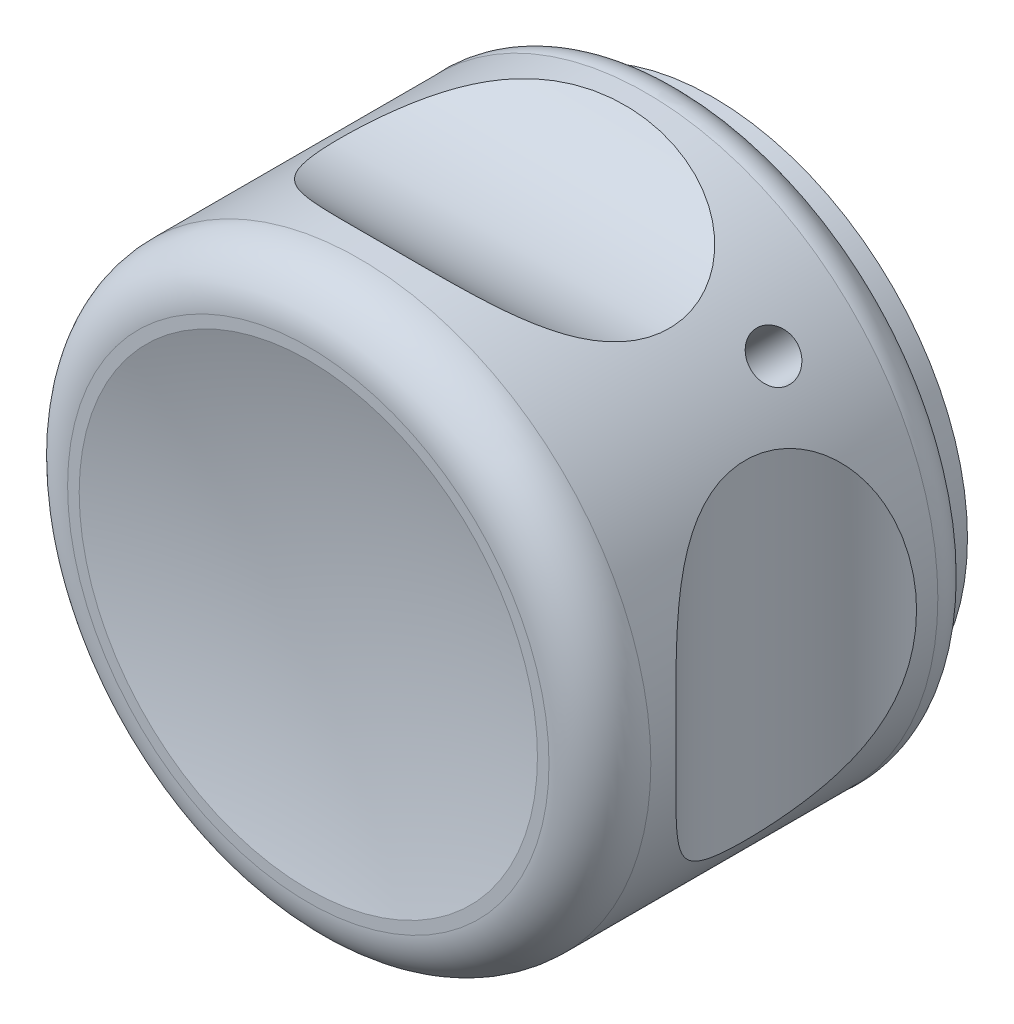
ISO-10303-21;
HEADER;
FILE_DESCRIPTION(('STEP AP214'),'2;1');
FILE_NAME('part.step','',(''),(''),'','','');
FILE_SCHEMA(('AUTOMOTIVE_DESIGN { 1 0 10303 214 1 1 1 1 }'));
ENDSEC;
DATA;
#1=APPLICATION_CONTEXT('core data for automotive mechanical design processes');
#2=APPLICATION_PROTOCOL_DEFINITION('international standard','automotive_design',2000,#1);
#3=PRODUCT_CONTEXT('',#1,'mechanical');
#4=PRODUCT('Part','Part','',(#3));
#5=PRODUCT_RELATED_PRODUCT_CATEGORY('part','',(#4));
#6=PRODUCT_DEFINITION_FORMATION('','',#4);
#7=PRODUCT_DEFINITION_CONTEXT('part definition',#1,'design');
#8=PRODUCT_DEFINITION('design','',#6,#7);
#9=PRODUCT_DEFINITION_SHAPE('','',#8);
#10=(LENGTH_UNIT() NAMED_UNIT(*) SI_UNIT(.MILLI.,.METRE.));
#11=(NAMED_UNIT(*) PLANE_ANGLE_UNIT() SI_UNIT($,.RADIAN.));
#12=(NAMED_UNIT(*) SI_UNIT($,.STERADIAN.) SOLID_ANGLE_UNIT());
#13=UNCERTAINTY_MEASURE_WITH_UNIT(LENGTH_MEASURE(1.E-05),#10,'distance_accuracy_value','');
#14=(GEOMETRIC_REPRESENTATION_CONTEXT(3) GLOBAL_UNCERTAINTY_ASSIGNED_CONTEXT((#13)) GLOBAL_UNIT_ASSIGNED_CONTEXT((#10,
#11,#12)) REPRESENTATION_CONTEXT('',''));
#15=CARTESIAN_POINT('',(0.,0.,0.));
#16=DIRECTION('',(0.,0.,1.));
#17=DIRECTION('',(1.,0.,0.));
#18=AXIS2_PLACEMENT_3D('',#15,#16,#17);
#19=CARTESIAN_POINT('',(0.,0.,-5.01878345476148));
#20=DIRECTION('',(0.,0.,-1.));
#21=DIRECTION('',(1.,0.,0.));
#22=AXIS2_PLACEMENT_3D('',#19,#20,#21);
#23=CYLINDRICAL_SURFACE('',#22,31.5);
#24=CARTESIAN_POINT('',(20.435836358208,23.9713702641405,16.));
#25=CARTESIAN_POINT('',(20.4358416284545,23.9713668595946,16.1401886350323));
#26=CARTESIAN_POINT('',(20.4448733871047,23.9636752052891,16.2804732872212));
#27=CARTESIAN_POINT('',(20.4807152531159,23.9330490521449,16.5571627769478));
#28=CARTESIAN_POINT('',(20.5075456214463,23.9100971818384,16.6935630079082));
#29=CARTESIAN_POINT('',(20.5780403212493,23.8494529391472,16.9584361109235));
#30=CARTESIAN_POINT('',(20.6216952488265,23.8117688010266,17.0869133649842));
#31=CARTESIAN_POINT('',(20.7243320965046,23.7224927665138,17.3323589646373));
#32=CARTESIAN_POINT('',(20.7833106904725,23.6709038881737,17.4493298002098));
#33=CARTESIAN_POINT('',(20.9147591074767,23.5548409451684,17.6687472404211));
#34=CARTESIAN_POINT('',(20.9872566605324,23.4903403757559,17.7711632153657));
#35=CARTESIAN_POINT('',(21.1432852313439,23.3499995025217,17.9583007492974));
#36=CARTESIAN_POINT('',(21.2268167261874,23.2741587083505,18.0430215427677));
#37=CARTESIAN_POINT('',(21.402351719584,23.1128437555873,18.1924644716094));
#38=CARTESIAN_POINT('',(21.4943661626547,23.0273571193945,18.2571602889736));
#39=CARTESIAN_POINT('',(21.6838916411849,22.8489772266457,18.3645484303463));
#40=CARTESIAN_POINT('',(21.7814025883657,22.7560840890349,18.4072411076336));
#41=CARTESIAN_POINT('',(21.9787396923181,22.5655437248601,18.4693234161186));
#42=CARTESIAN_POINT('',(22.078560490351,22.4679070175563,18.4887623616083));
#43=CARTESIAN_POINT('',(22.2777797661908,22.2703884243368,18.5039378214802));
#44=CARTESIAN_POINT('',(22.3771782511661,22.1705065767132,18.4996747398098));
#45=CARTESIAN_POINT('',(22.5725174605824,21.9715918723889,18.4676075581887));
#46=CARTESIAN_POINT('',(22.6684654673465,21.8725576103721,18.4398564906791));
#47=CARTESIAN_POINT('',(22.8545522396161,21.678043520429,18.3616835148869));
#48=CARTESIAN_POINT('',(22.9446909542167,21.5825637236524,18.3112614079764));
#49=CARTESIAN_POINT('',(23.1169396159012,21.3979689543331,18.1891183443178));
#50=CARTESIAN_POINT('',(23.1990404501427,21.3088612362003,18.1173735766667));
#51=CARTESIAN_POINT('',(23.3530878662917,21.1399237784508,17.9546390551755));
#52=CARTESIAN_POINT('',(23.425034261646,21.0600942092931,17.8636489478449));
#53=CARTESIAN_POINT('',(23.5572680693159,20.9120783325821,17.6647075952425));
#54=CARTESIAN_POINT('',(23.617522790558,20.8439247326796,17.5567102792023));
#55=CARTESIAN_POINT('',(23.7247542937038,20.7217919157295,17.3269808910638));
#56=CARTESIAN_POINT('',(23.7717310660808,20.667812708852,17.2052488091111));
#57=CARTESIAN_POINT('',(23.8513680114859,20.5758587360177,16.9514735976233));
#58=CARTESIAN_POINT('',(23.8840266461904,20.5378856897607,16.8194293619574));
#59=CARTESIAN_POINT('',(23.9343035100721,20.479272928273,16.5487931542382));
#60=CARTESIAN_POINT('',(23.9519220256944,20.4586328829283,16.4102013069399));
#61=CARTESIAN_POINT('',(23.9717089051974,20.435444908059,16.130808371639));
#62=CARTESIAN_POINT('',(23.9739192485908,20.4328478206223,15.9900143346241));
#63=CARTESIAN_POINT('',(23.9629532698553,20.4457071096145,15.7098583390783));
#64=CARTESIAN_POINT('',(23.9497770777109,20.4611633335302,15.5704963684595));
#65=CARTESIAN_POINT('',(23.9083506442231,20.5095531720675,15.2973448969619));
#66=CARTESIAN_POINT('',(23.8801200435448,20.5424640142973,15.1635483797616));
#67=CARTESIAN_POINT('',(23.809209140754,20.6246087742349,14.9051086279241));
#68=CARTESIAN_POINT('',(23.7665286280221,20.6738429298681,14.7804655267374));
#69=CARTESIAN_POINT('',(23.667546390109,20.7870847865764,14.5435756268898));
#70=CARTESIAN_POINT('',(23.611215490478,20.8511241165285,14.4313561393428));
#71=CARTESIAN_POINT('',(23.4862464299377,20.9917854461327,14.2227748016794));
#72=CARTESIAN_POINT('',(23.4176080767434,21.0684076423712,14.1264131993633));
#73=CARTESIAN_POINT('',(23.2694499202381,21.2319306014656,13.9520634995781));
#74=CARTESIAN_POINT('',(23.1899059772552,21.3188541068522,13.8741172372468));
#75=CARTESIAN_POINT('',(23.0219905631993,21.5000741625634,13.7390977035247));
#76=CARTESIAN_POINT('',(22.9336191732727,21.5943706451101,13.6820242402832));
#77=CARTESIAN_POINT('',(22.750411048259,21.7873004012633,13.5904424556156));
#78=CARTESIAN_POINT('',(22.6555819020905,21.8859285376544,13.5559081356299));
#79=CARTESIAN_POINT('',(22.4619074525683,22.0846542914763,13.5102999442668));
#80=CARTESIAN_POINT('',(22.3630622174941,22.1847518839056,13.4992256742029));
#81=CARTESIAN_POINT('',(22.1644005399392,22.3832305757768,13.500856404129));
#82=CARTESIAN_POINT('',(22.0645875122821,22.4816156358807,13.5134961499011));
#83=CARTESIAN_POINT('',(21.8666182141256,22.6742163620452,13.5620602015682));
#84=CARTESIAN_POINT('',(21.7684619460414,22.768432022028,13.5979845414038));
#85=CARTESIAN_POINT('',(21.5767539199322,22.9501884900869,13.6920817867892));
#86=CARTESIAN_POINT('',(21.4832019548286,23.0377295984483,13.7502536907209));
#87=CARTESIAN_POINT('',(21.3035830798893,23.2039293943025,13.8871870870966));
#88=CARTESIAN_POINT('',(21.2175160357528,23.2825882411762,13.9659482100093));
#89=CARTESIAN_POINT('',(21.0553728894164,23.4293252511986,14.1420689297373));
#90=CARTESIAN_POINT('',(20.9793235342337,23.4973751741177,14.2394766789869));
#91=CARTESIAN_POINT('',(20.8399427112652,23.6210816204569,14.4500415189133));
#92=CARTESIAN_POINT('',(20.7766143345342,23.6767351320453,14.5632024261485));
#93=CARTESIAN_POINT('',(20.6647188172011,23.7744598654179,14.8022614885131));
#94=CARTESIAN_POINT('',(20.6161775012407,23.8165073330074,14.9281814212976));
#95=CARTESIAN_POINT('',(20.5357151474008,23.885921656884,15.1889386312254));
#96=CARTESIAN_POINT('',(20.5037749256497,23.9133054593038,15.3237654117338));
#97=CARTESIAN_POINT('',(20.4657906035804,23.9458090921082,15.5494950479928));
#98=CARTESIAN_POINT('',(20.4545752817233,23.9553845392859,15.6389444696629));
#99=CARTESIAN_POINT('',(20.4395964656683,23.9681662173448,15.8189159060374));
#100=CARTESIAN_POINT('',(20.4358329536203,23.9713724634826,15.9094379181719));
#101=CARTESIAN_POINT('',(20.435836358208,23.9713702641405,16.));
#102=B_SPLINE_CURVE_WITH_KNOTS('',3,(#24,#25,#26,#27,#28,#29,#30,#31,#32,#33,#34,#35,#36,#37,
#38,#39,#40,#41,#42,#43,#44,#45,#46,#47,#48,#49,#50,#51,#52,#53,#54,#55,#56,#57,#58,#59,#60,#61,
#62,#63,#64,#65,#66,#67,#68,#69,#70,#71,#72,#73,#74,#75,#76,#77,#78,#79,#80,#81,#82,#83,#84,#85,
#86,#87,#88,#89,#90,#91,#92,#93,#94,#95,#96,#97,#98,#99,#100,#101),.UNSPECIFIED.,.T.,.F.,(4,2,2,
2,2,2,2,2,2,2,2,2,2,2,2,2,2,2,2,2,2,2,2,2,2,2,2,2,2,2,2,2,2,2,2,2,2,2,4),(0.,0.420235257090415,
0.840949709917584,1.26142934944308,1.68181779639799,2.10307822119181,2.52435686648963,
2.94618685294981,3.36801006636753,3.78893712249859,4.20985700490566,4.62982903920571,
5.04980475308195,5.47025122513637,5.89070542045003,6.31231882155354,6.73393252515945,
7.15559151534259,7.5772424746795,7.99774419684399,8.41824236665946,8.83819327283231,
9.25815030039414,9.67901292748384,10.0998821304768,10.5216984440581,10.9435108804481,
11.3648358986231,11.7861537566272,12.2063139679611,12.6264747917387,13.0466167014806,
13.466751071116,13.8879853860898,14.309321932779,14.731390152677,15.1529695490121,
15.4244428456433,15.695915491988),.UNSPECIFIED.);
#103=CARTESIAN_POINT('',(20.435836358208,23.9713702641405,16.));
#104=VERTEX_POINT('',#103);
#105=EDGE_CURVE('E118',#104,#104,#102,.T.);
#106=ORIENTED_EDGE('',*,*,#105,.F.);
#107=EDGE_LOOP('',(#106));
#108=FACE_BOUND('',#107,.T.);
#109=CARTESIAN_POINT('',(-31.5,-4.9960036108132E-13,35.7999846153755));
#110=CARTESIAN_POINT('',(-31.4999974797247,0.596467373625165,35.7999876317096));
#111=CARTESIAN_POINT('',(-31.4830348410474,1.19298361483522,35.7835892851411));
#112=CARTESIAN_POINT('',(-31.4154308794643,2.38234994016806,35.7174770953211));
#113=CARTESIAN_POINT('',(-31.3647835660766,2.97519935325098,35.6677573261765));
#114=CARTESIAN_POINT('',(-31.2306090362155,4.15339272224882,35.5334236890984));
#115=CARTESIAN_POINT('',(-31.1470718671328,4.73873435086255,35.4487992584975));
#116=CARTESIAN_POINT('',(-30.9486154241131,5.89731848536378,35.2421166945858));
#117=CARTESIAN_POINT('',(-30.8337035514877,6.47056381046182,35.1200673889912));
#118=CARTESIAN_POINT('',(-30.5986807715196,7.49630442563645,34.8612611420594));
#119=CARTESIAN_POINT('',(-30.4834028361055,7.95163669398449,34.7313247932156));
#120=CARTESIAN_POINT('',(-30.2353909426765,8.84800860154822,34.4419144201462));
#121=CARTESIAN_POINT('',(-30.1026573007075,9.28904849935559,34.2824409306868));
#122=CARTESIAN_POINT('',(-29.8224317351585,10.1527545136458,33.931725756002));
#123=CARTESIAN_POINT('',(-29.6749601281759,10.5754448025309,33.7405275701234));
#124=CARTESIAN_POINT('',(-29.3684087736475,11.3990993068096,33.3237222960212));
#125=CARTESIAN_POINT('',(-29.2093320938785,11.8000692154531,33.0981242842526));
#126=CARTESIAN_POINT('',(-28.9207531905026,12.487832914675,32.6656593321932));
#127=CARTESIAN_POINT('',(-28.792729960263,12.7798905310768,32.4661561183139));
#128=CARTESIAN_POINT('',(-28.5346554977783,13.3461668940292,32.0444620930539));
#129=CARTESIAN_POINT('',(-28.4046046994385,13.6203893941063,31.8222760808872));
#130=CARTESIAN_POINT('',(-28.1452742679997,14.1484994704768,31.3549066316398));
#131=CARTESIAN_POINT('',(-28.0159941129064,14.4024027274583,31.1097412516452));
#132=CARTESIAN_POINT('',(-27.7611457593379,14.8877093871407,30.5962705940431));
#133=CARTESIAN_POINT('',(-27.6355770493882,15.1191159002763,30.3279685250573));
#134=CARTESIAN_POINT('',(-27.4099276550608,15.523890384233,29.8111940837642));
#135=CARTESIAN_POINT('',(-27.3088670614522,15.7007404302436,29.5658729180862));
#136=CARTESIAN_POINT('',(-27.1138565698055,16.0351564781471,29.0597709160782));
#137=CARTESIAN_POINT('',(-27.0199054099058,16.1927259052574,28.7989928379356));
#138=CARTESIAN_POINT('',(-26.8411642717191,16.4873165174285,28.263079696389));
#139=CARTESIAN_POINT('',(-26.7563737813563,16.6243388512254,27.9879454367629));
#140=CARTESIAN_POINT('',(-26.5979135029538,16.876706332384,27.424800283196));
#141=CARTESIAN_POINT('',(-26.5242439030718,16.9920511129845,27.1367891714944));
#142=CARTESIAN_POINT('',(-26.389509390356,17.2005608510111,26.5484135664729));
#143=CARTESIAN_POINT('',(-26.328503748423,17.2936218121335,26.2479985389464));
#144=CARTESIAN_POINT('',(-26.2210728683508,17.4560831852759,25.6382729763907));
#145=CARTESIAN_POINT('',(-26.1746478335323,17.5254832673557,25.3289623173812));
#146=CARTESIAN_POINT('',(-26.0975952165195,17.6400198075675,24.7039927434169));
#147=CARTESIAN_POINT('',(-26.0669649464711,17.6851603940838,24.3883349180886));
#148=CARTESIAN_POINT('',(-26.0223042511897,17.75081051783,23.7533135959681));
#149=CARTESIAN_POINT('',(-26.0082725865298,17.7713218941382,23.4339503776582));
#150=CARTESIAN_POINT('',(-25.9976398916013,17.7868708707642,22.8210754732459));
#151=CARTESIAN_POINT('',(-25.9996794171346,17.7838951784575,22.5276351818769));
#152=CARTESIAN_POINT('',(-26.0179547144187,17.7571478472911,21.9421615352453));
#153=CARTESIAN_POINT('',(-26.0341895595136,17.733377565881,21.6501280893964));
#154=CARTESIAN_POINT('',(-26.0804863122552,17.6652178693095,21.0696599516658));
#155=CARTESIAN_POINT('',(-26.1105450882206,17.6208331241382,20.7812244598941));
#156=CARTESIAN_POINT('',(-26.1838219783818,17.5117610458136,20.2099213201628));
#157=CARTESIAN_POINT('',(-26.227040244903,17.4470734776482,19.9270537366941));
#158=CARTESIAN_POINT('',(-26.3250937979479,17.2987638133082,19.3721764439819));
#159=CARTESIAN_POINT('',(-26.3797820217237,17.2153805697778,19.1000767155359));
#160=CARTESIAN_POINT('',(-26.499939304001,17.0298391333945,18.5648258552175));
#161=CARTESIAN_POINT('',(-26.5654081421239,16.9276813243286,18.3016745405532));
#162=CARTESIAN_POINT('',(-26.7057979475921,16.7053173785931,17.7857806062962));
#163=CARTESIAN_POINT('',(-26.7807177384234,16.5851134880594,17.5330366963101));
#164=CARTESIAN_POINT('',(-26.9385907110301,16.3274357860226,17.0390242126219));
#165=CARTESIAN_POINT('',(-27.0215468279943,16.1899556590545,16.7977598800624));
#166=CARTESIAN_POINT('',(-27.1996565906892,15.8890284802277,16.3121443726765));
#167=CARTESIAN_POINT('',(-27.2952542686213,15.7244642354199,16.0686487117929));
#168=CARTESIAN_POINT('',(-27.4919364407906,15.3780072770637,15.5966536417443));
#169=CARTESIAN_POINT('',(-27.5930216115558,15.1961124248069,15.3681560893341));
#170=CARTESIAN_POINT('',(-27.7988541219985,14.8162200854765,14.9265670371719));
#171=CARTESIAN_POINT('',(-27.9036029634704,14.618215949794,14.7134819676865));
#172=CARTESIAN_POINT('',(-28.1149287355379,14.2075382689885,14.3030411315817));
#173=CARTESIAN_POINT('',(-28.2215054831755,13.994866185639,14.1056838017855));
#174=CARTESIAN_POINT('',(-28.4791478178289,13.4650327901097,13.6478869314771));
#175=CARTESIAN_POINT('',(-28.6303196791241,13.141138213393,13.3952613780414));
#176=CARTESIAN_POINT('',(-28.9288925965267,12.4701304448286,12.9204302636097));
#177=CARTESIAN_POINT('',(-29.0762924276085,12.123009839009,12.698234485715));
#178=CARTESIAN_POINT('',(-29.3640475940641,11.4083874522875,12.2825271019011));
#179=CARTESIAN_POINT('',(-29.5043904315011,11.0408517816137,12.0890652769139));
#180=CARTESIAN_POINT('',(-29.7748959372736,10.2890851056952,11.7295592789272));
#181=CARTESIAN_POINT('',(-29.9050583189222,9.90485363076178,11.5635158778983));
#182=CARTESIAN_POINT('',(-30.1884655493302,9.0102751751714,11.2130410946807));
#183=CARTESIAN_POINT('',(-30.3376339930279,8.49534475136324,11.0369789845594));
#184=CARTESIAN_POINT('',(-30.6117133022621,7.44758673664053,10.7233739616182));
#185=CARTESIAN_POINT('',(-30.7366173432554,6.91475415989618,10.5858418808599));
#186=CARTESIAN_POINT('',(-30.9596468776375,5.8355784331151,10.3459707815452));
#187=CARTESIAN_POINT('',(-31.0577630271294,5.28923064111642,10.2436440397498));
#188=CARTESIAN_POINT('',(-31.2254412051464,4.18718590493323,10.0715956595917));
#189=CARTESIAN_POINT('',(-31.295005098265,3.6314895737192,10.0018718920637));
#190=CARTESIAN_POINT('',(-31.4053042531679,2.50620318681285,9.8923335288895));
#191=CARTESIAN_POINT('',(-31.4456112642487,1.93652820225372,9.85296273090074));
#192=CARTESIAN_POINT('',(-31.4951641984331,0.794549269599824,9.80466355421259));
#193=CARTESIAN_POINT('',(-31.5044096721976,0.222245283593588,9.79573561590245));
#194=CARTESIAN_POINT('',(-31.4917020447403,-0.922180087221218,9.80806843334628));
#195=CARTESIAN_POINT('',(-31.4697227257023,-1.49430091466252,9.82935455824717));
#196=CARTESIAN_POINT('',(-31.3948349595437,-2.63454723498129,9.90278131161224));
#197=CARTESIAN_POINT('',(-31.341925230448,-3.2026725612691,9.95492321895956));
#198=CARTESIAN_POINT('',(-31.1987342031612,-4.39137188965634,10.0988092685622));
#199=CARTESIAN_POINT('',(-31.1050828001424,-5.01111363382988,10.1941688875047));
#200=CARTESIAN_POINT('',(-30.8827885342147,-6.23627750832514,10.4276876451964));
#201=CARTESIAN_POINT('',(-30.7541373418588,-6.8416961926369,10.5658569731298));
#202=CARTESIAN_POINT('',(-30.4651371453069,-8.03111236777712,10.8891232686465));
#203=CARTESIAN_POINT('',(-30.3048474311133,-8.61514754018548,11.0741326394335));
#204=CARTESIAN_POINT('',(-30.0441991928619,-9.47022640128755,11.3906636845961));
#205=CARTESIAN_POINT('',(-29.9539593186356,-9.7517251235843,11.5026613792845));
#206=CARTESIAN_POINT('',(-29.7675155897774,-10.3068250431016,11.7403787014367));
#207=CARTESIAN_POINT('',(-29.6713125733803,-10.5804273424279,11.86609640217));
#208=CARTESIAN_POINT('',(-29.4476953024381,-11.1899341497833,12.1671444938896));
#209=CARTESIAN_POINT('',(-29.3187592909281,-11.5231627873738,12.3467994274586));
#210=CARTESIAN_POINT('',(-29.0550453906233,-12.1728057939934,12.730413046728));
#211=CARTESIAN_POINT('',(-28.9202691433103,-12.4892248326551,12.9343649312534));
#212=CARTESIAN_POINT('',(-28.6476941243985,-13.1023676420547,13.36741693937));
#213=CARTESIAN_POINT('',(-28.5098993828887,-13.3991157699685,13.596484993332));
#214=CARTESIAN_POINT('',(-28.2342673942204,-13.9705670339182,14.0806625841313));
#215=CARTESIAN_POINT('',(-28.0964301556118,-14.2452732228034,14.3357685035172));
#216=CARTESIAN_POINT('',(-27.8467498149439,-14.7264882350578,14.8278530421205));
#217=CARTESIAN_POINT('',(-27.7343709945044,-14.9367699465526,15.0608750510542));
#218=CARTESIAN_POINT('',(-27.5143364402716,-15.3383077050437,15.5448244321));
#219=CARTESIAN_POINT('',(-27.406679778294,-15.5295675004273,15.795748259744));
#220=CARTESIAN_POINT('',(-27.1984172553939,-15.8914983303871,16.3148406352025));
#221=CARTESIAN_POINT('',(-27.0978117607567,-16.0621682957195,16.5830100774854));
#222=CARTESIAN_POINT('',(-26.9060235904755,-16.3814099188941,17.1354356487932));
#223=CARTESIAN_POINT('',(-26.8148410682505,-16.5299812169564,17.4196920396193));
#224=CARTESIAN_POINT('',(-26.6436721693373,-16.804495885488,18.0044323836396));
#225=CARTESIAN_POINT('',(-26.5637564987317,-16.9302976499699,18.3050037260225));
#226=CARTESIAN_POINT('',(-26.4179077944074,-17.1569910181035,18.9187063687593));
#227=CARTESIAN_POINT('',(-26.351975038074,-17.2578821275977,19.2318379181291));
#228=CARTESIAN_POINT('',(-26.2359404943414,-17.4337759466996,19.8680526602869));
#229=CARTESIAN_POINT('',(-26.185833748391,-17.5087867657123,20.1911327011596));
#230=CARTESIAN_POINT('',(-26.1028564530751,-17.6322558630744,20.8444907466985));
#231=CARTESIAN_POINT('',(-26.069984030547,-17.6807170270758,21.1747679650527));
#232=CARTESIAN_POINT('',(-26.0249784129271,-17.746884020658,21.8036478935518));
#233=CARTESIAN_POINT('',(-26.0109936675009,-17.7673389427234,22.1018331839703));
#234=CARTESIAN_POINT('',(-25.9978174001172,-17.78661402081,22.6992156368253));
#235=CARTESIAN_POINT('',(-25.9986246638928,-17.7854359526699,22.9984127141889));
#236=CARTESIAN_POINT('',(-26.015010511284,-17.7614592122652,23.5954396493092));
#237=CARTESIAN_POINT('',(-26.0305847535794,-17.7386668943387,23.8932698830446));
#238=CARTESIAN_POINT('',(-26.0761355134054,-17.6716381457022,24.4853923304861));
#239=CARTESIAN_POINT('',(-26.1061120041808,-17.6274017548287,24.7796845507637));
#240=CARTESIAN_POINT('',(-26.1784662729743,-17.5197586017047,25.3522102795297));
#241=CARTESIAN_POINT('',(-26.2203665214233,-17.4570873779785,25.6306431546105));
#242=CARTESIAN_POINT('',(-26.3160323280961,-17.3125372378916,26.1803739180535));
#243=CARTESIAN_POINT('',(-26.3697974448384,-17.2306590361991,26.4516720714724));
#244=CARTESIAN_POINT('',(-26.4880831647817,-17.048262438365,26.9854999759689));
#245=CARTESIAN_POINT('',(-26.5526036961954,-16.9477441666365,27.248029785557));
#246=CARTESIAN_POINT('',(-26.6911091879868,-16.7287615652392,27.7629026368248));
#247=CARTESIAN_POINT('',(-26.7650944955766,-16.6102965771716,28.0152453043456));
#248=CARTESIAN_POINT('',(-26.9246776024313,-16.3504136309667,28.5198465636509));
#249=CARTESIAN_POINT('',(-27.0106519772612,-16.2081931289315,28.7715723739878));
#250=CARTESIAN_POINT('',(-27.1897034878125,-15.9060010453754,29.2616038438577));
#251=CARTESIAN_POINT('',(-27.2827835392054,-15.7460221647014,29.499903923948));
#252=CARTESIAN_POINT('',(-27.4742506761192,-15.4095103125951,29.962203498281));
#253=CARTESIAN_POINT('',(-27.5726373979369,-15.232978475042,30.1862039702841));
#254=CARTESIAN_POINT('',(-27.7730000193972,-14.8645366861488,30.6194812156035));
#255=CARTESIAN_POINT('',(-27.8749763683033,-14.6726248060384,30.8287561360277));
#256=CARTESIAN_POINT('',(-28.0938371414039,-14.2495587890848,31.2578244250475));
#257=CARTESIAN_POINT('',(-28.2109798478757,-14.0165079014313,31.4756161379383));
#258=CARTESIAN_POINT('',(-28.4454970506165,-13.5342384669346,31.8923174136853));
#259=CARTESIAN_POINT('',(-28.5628715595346,-13.2850190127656,32.0912259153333));
#260=CARTESIAN_POINT('',(-28.7959454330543,-12.7719591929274,32.4706555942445));
#261=CARTESIAN_POINT('',(-28.9116436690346,-12.5081095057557,32.6511648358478));
#262=CARTESIAN_POINT('',(-29.1395593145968,-11.9675484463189,32.9942641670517));
#263=CARTESIAN_POINT('',(-29.2517760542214,-11.6908346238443,33.1568508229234));
#264=CARTESIAN_POINT('',(-29.5276333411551,-10.9808450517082,33.5440305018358));
#265=CARTESIAN_POINT('',(-29.6880501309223,-10.5402199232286,33.757526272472));
#266=CARTESIAN_POINT('',(-29.9931661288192,-9.63779846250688,34.1480073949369));
#267=CARTESIAN_POINT('',(-30.1378587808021,-9.17599341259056,34.3249775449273));
#268=CARTESIAN_POINT('',(-30.4084699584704,-8.23498233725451,34.6455035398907));
#269=CARTESIAN_POINT('',(-30.5343655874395,-7.75575595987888,34.7890187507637));
#270=CARTESIAN_POINT('',(-30.7648150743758,-6.78420450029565,35.04508520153));
#271=CARTESIAN_POINT('',(-30.8693715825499,-6.29188105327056,35.1576402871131));
#272=CARTESIAN_POINT('',(-31.0506610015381,-5.32320611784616,35.3490458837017));
#273=CARTESIAN_POINT('',(-31.1285582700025,-4.84735585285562,35.4293450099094));
#274=CARTESIAN_POINT('',(-31.2627239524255,-3.88922829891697,35.5658390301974));
#275=CARTESIAN_POINT('',(-31.3189931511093,-3.4069512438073,35.6220347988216));
#276=CARTESIAN_POINT('',(-31.4092566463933,-2.43827564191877,35.7114756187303));
#277=CARTESIAN_POINT('',(-31.4432537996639,-1.95187763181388,35.7447236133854));
#278=CARTESIAN_POINT('',(-31.4886275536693,-0.976997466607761,35.7889779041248));
#279=CARTESIAN_POINT('',(-31.5000020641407,-0.488515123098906,35.7999821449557));
#280=CARTESIAN_POINT('',(-31.5,-4.9960036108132E-13,35.7999846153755));
#281=B_SPLINE_CURVE_WITH_KNOTS('',3,(#109,#110,#111,#112,#113,#114,#115,#116,#117,#118,#119,
#120,#121,#122,#123,#124,#125,#126,#127,#128,#129,#130,#131,#132,#133,#134,#135,#136,#137,#138,
#139,#140,#141,#142,#143,#144,#145,#146,#147,#148,#149,#150,#151,#152,#153,#154,#155,#156,#157,
#158,#159,#160,#161,#162,#163,#164,#165,#166,#167,#168,#169,#170,#171,#172,#173,#174,#175,#176,
#177,#178,#179,#180,#181,#182,#183,#184,#185,#186,#187,#188,#189,#190,#191,#192,#193,#194,#195,
#196,#197,#198,#199,#200,#201,#202,#203,#204,#205,#206,#207,#208,#209,#210,#211,#212,#213,#214,
#215,#216,#217,#218,#219,#220,#221,#222,#223,#224,#225,#226,#227,#228,#229,#230,#231,#232,#233,
#234,#235,#236,#237,#238,#239,#240,#241,#242,#243,#244,#245,#246,#247,#248,#249,#250,#251,#252,
#253,#254,#255,#256,#257,#258,#259,#260,#261,#262,#263,#264,#265,#266,#267,#268,#269,#270,#271,
#272,#273,#274,#275,#276,#277,#278,#279,#280),.UNSPECIFIED.,.T.,.F.,(4,2,2,2,2,2,2,2,2,2,2,2,2,
2,2,2,2,2,2,2,2,2,2,2,2,2,2,2,2,2,2,2,2,2,2,2,2,2,2,2,2,2,2,2,2,2,2,2,2,2,2,2,2,2,2,2,2,2,2,2,2,
2,2,2,2,2,2,2,2,2,2,2,2,2,2,2,2,2,2,2,2,2,2,2,2,4),(0.,1.78901804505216,3.57835433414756,
5.36823250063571,7.15768879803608,8.61841711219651,10.0791189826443,11.5378343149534,
12.9961654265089,14.1236150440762,15.2508266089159,16.3771597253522,17.5033368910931,
18.4589482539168,19.4143896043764,20.3697775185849,21.3251815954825,22.2849611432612,
23.2447540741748,24.2043836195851,25.1639415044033,26.0432606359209,26.9225223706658,
27.8015850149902,28.6806578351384,29.5490821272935,30.4174886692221,31.2857872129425,
32.1544040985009,33.0805997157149,34.0069097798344,34.9336041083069,35.8602062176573,
37.1713779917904,38.4829703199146,39.7968090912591,41.1106848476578,42.8011265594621,
44.4920430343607,46.1835485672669,47.874943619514,49.5906230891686,51.3063273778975,
53.0234731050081,54.7406900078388,56.6401428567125,58.5400481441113,60.4364262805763,
61.384392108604,62.3322249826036,63.5309150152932,64.7292702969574,65.9261128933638,
67.1227894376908,68.1219716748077,69.1209566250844,70.1199934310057,71.1190465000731,
72.124113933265,73.1292013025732,74.1339734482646,75.1386363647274,76.0351535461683,
76.9315971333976,77.8277772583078,78.7239557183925,79.5883503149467,80.4527127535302,
81.3170694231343,82.1814578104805,83.0854205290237,83.9897561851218,84.8940299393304,
85.7984172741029,86.8168544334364,87.8353487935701,88.8544997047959,89.8738455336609,
91.4172687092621,92.9613329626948,94.5072629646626,96.0530008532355,97.5183374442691,
98.9836208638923,100.448716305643,101.913947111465),.UNSPECIFIED.);
#282=CARTESIAN_POINT('',(-31.5,-4.9960036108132E-13,35.7999846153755));
#283=VERTEX_POINT('',#282);
#284=EDGE_CURVE('E8',#283,#283,#281,.T.);
#285=ORIENTED_EDGE('',*,*,#284,.F.);
#286=EDGE_LOOP('',(#285));
#287=FACE_BOUND('',#286,.T.);
#288=CARTESIAN_POINT('',(0.,31.5,35.7999846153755));
#289=CARTESIAN_POINT('',(-0.596467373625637,31.4999974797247,35.7999876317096));
#290=CARTESIAN_POINT('',(-1.19298361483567,31.4830348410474,35.783589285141));
#291=CARTESIAN_POINT('',(-2.38234994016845,31.4154308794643,35.717477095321));
#292=CARTESIAN_POINT('',(-2.97519935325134,31.3647835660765,35.6677573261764));
#293=CARTESIAN_POINT('',(-4.15339272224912,31.2306090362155,35.5334236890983));
#294=CARTESIAN_POINT('',(-4.73873435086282,31.1470718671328,35.4487992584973));
#295=CARTESIAN_POINT('',(-5.89731848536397,30.948615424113,35.2421166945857));
#296=CARTESIAN_POINT('',(-6.47056381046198,30.8337035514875,35.1200673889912));
#297=CARTESIAN_POINT('',(-7.49630442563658,30.5986807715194,34.8612611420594));
#298=CARTESIAN_POINT('',(-7.95163669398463,30.4834028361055,34.7313247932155));
#299=CARTESIAN_POINT('',(-8.84800860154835,30.2353909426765,34.4419144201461));
#300=CARTESIAN_POINT('',(-9.28904849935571,30.1026573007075,34.2824409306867));
#301=CARTESIAN_POINT('',(-10.1527545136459,29.8224317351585,33.9317257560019));
#302=CARTESIAN_POINT('',(-10.5754448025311,29.6749601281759,33.7405275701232));
#303=CARTESIAN_POINT('',(-11.3990993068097,29.3684087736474,33.3237222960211));
#304=CARTESIAN_POINT('',(-11.8000692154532,29.2093320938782,33.0981242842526));
#305=CARTESIAN_POINT('',(-12.4878329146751,28.9207531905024,32.6656593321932));
#306=CARTESIAN_POINT('',(-12.7798905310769,28.7927299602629,32.4661561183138));
#307=CARTESIAN_POINT('',(-13.3461668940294,28.5346554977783,32.0444620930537));
#308=CARTESIAN_POINT('',(-13.6203893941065,28.4046046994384,31.822276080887));
#309=CARTESIAN_POINT('',(-14.148499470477,28.1452742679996,31.3549066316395));
#310=CARTESIAN_POINT('',(-14.4024027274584,28.0159941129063,31.1097412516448));
#311=CARTESIAN_POINT('',(-14.8877093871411,27.7611457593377,30.5962705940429));
#312=CARTESIAN_POINT('',(-15.1191159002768,27.6355770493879,30.3279685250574));
#313=CARTESIAN_POINT('',(-15.5238903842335,27.4099276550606,29.8111940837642));
#314=CARTESIAN_POINT('',(-15.7007404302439,27.308867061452,29.565872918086));
#315=CARTESIAN_POINT('',(-16.0351564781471,27.1138565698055,29.0597709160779));
#316=CARTESIAN_POINT('',(-16.1927259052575,27.0199054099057,28.7989928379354));
#317=CARTESIAN_POINT('',(-16.4873165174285,26.8411642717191,28.2630796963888));
#318=CARTESIAN_POINT('',(-16.6243388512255,26.7563737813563,27.9879454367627));
#319=CARTESIAN_POINT('',(-16.8767063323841,26.5979135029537,27.4248002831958));
#320=CARTESIAN_POINT('',(-16.9920511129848,26.5242439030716,27.1367891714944));
#321=CARTESIAN_POINT('',(-17.2005608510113,26.3895093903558,26.5484135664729));
#322=CARTESIAN_POINT('',(-17.2936218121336,26.3285037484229,26.2479985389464));
#323=CARTESIAN_POINT('',(-17.4560831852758,26.2210728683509,25.6382729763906));
#324=CARTESIAN_POINT('',(-17.5254832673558,26.1746478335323,25.3289623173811));
#325=CARTESIAN_POINT('',(-17.6400198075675,26.0975952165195,24.7039927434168));
#326=CARTESIAN_POINT('',(-17.6851603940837,26.0669649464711,24.3883349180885));
#327=CARTESIAN_POINT('',(-17.7508105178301,26.0223042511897,23.7533135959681));
#328=CARTESIAN_POINT('',(-17.7713218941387,26.0082725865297,23.4339503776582));
#329=CARTESIAN_POINT('',(-17.7868708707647,25.9976398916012,22.8210754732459));
#330=CARTESIAN_POINT('',(-17.7838951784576,25.9996794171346,22.527635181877));
#331=CARTESIAN_POINT('',(-17.757147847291,26.0179547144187,21.9421615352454));
#332=CARTESIAN_POINT('',(-17.733377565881,26.0341895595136,21.6501280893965));
#333=CARTESIAN_POINT('',(-17.6652178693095,26.0804863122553,21.0696599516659));
#334=CARTESIAN_POINT('',(-17.6208331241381,26.1105450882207,20.7812244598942));
#335=CARTESIAN_POINT('',(-17.5117610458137,26.1838219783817,20.2099213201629));
#336=CARTESIAN_POINT('',(-17.4470734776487,26.2270402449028,19.927053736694));
#337=CARTESIAN_POINT('',(-17.2987638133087,26.3250937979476,19.372176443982));
#338=CARTESIAN_POINT('',(-17.2153805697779,26.3797820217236,19.1000767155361));
#339=CARTESIAN_POINT('',(-17.0298391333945,26.499939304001,18.5648258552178));
#340=CARTESIAN_POINT('',(-16.9276813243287,26.5654081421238,18.3016745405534));
#341=CARTESIAN_POINT('',(-16.7053173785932,26.705797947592,17.7857806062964));
#342=CARTESIAN_POINT('',(-16.5851134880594,26.7807177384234,17.5330366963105));
#343=CARTESIAN_POINT('',(-16.3274357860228,26.9385907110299,17.0390242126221));
#344=CARTESIAN_POINT('',(-16.1899556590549,27.021546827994,16.7977598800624));
#345=CARTESIAN_POINT('',(-15.8890284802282,27.1996565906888,16.3121443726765));
#346=CARTESIAN_POINT('',(-15.7244642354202,27.2952542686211,16.0686487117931));
#347=CARTESIAN_POINT('',(-15.3780072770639,27.4919364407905,15.5966536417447));
#348=CARTESIAN_POINT('',(-15.1961124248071,27.5930216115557,15.3681560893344));
#349=CARTESIAN_POINT('',(-14.8162200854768,27.7988541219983,14.9265670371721));
#350=CARTESIAN_POINT('',(-14.6182159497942,27.9036029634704,14.7134819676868));
#351=CARTESIAN_POINT('',(-14.2075382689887,28.1149287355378,14.3030411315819));
#352=CARTESIAN_POINT('',(-13.9948661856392,28.2215054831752,14.1056838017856));
#353=CARTESIAN_POINT('',(-13.4650327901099,28.4791478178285,13.647886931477));
#354=CARTESIAN_POINT('',(-13.1411382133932,28.6303196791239,13.3952613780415));
#355=CARTESIAN_POINT('',(-12.4701304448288,28.9288925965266,12.9204302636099));
#356=CARTESIAN_POINT('',(-12.1230098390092,29.0762924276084,12.6982344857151));
#357=CARTESIAN_POINT('',(-11.4083874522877,29.364047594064,12.2825271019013));
#358=CARTESIAN_POINT('',(-11.0408517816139,29.5043904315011,12.0890652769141));
#359=CARTESIAN_POINT('',(-10.2890851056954,29.7748959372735,11.7295592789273));
#360=CARTESIAN_POINT('',(-9.90485363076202,29.905058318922,11.5635158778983));
#361=CARTESIAN_POINT('',(-9.01027517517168,30.18846554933,11.2130410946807));
#362=CARTESIAN_POINT('',(-8.49534475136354,30.3376339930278,11.0369789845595));
#363=CARTESIAN_POINT('',(-7.44758673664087,30.6117133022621,10.7233739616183));
#364=CARTESIAN_POINT('',(-6.91475415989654,30.7366173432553,10.5858418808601));
#365=CARTESIAN_POINT('',(-5.83557843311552,30.9596468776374,10.3459707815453));
#366=CARTESIAN_POINT('',(-5.28923064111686,31.0577630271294,10.2436440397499));
#367=CARTESIAN_POINT('',(-4.18718590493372,31.2254412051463,10.0715956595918));
#368=CARTESIAN_POINT('',(-3.63148957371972,31.2950050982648,10.0018718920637));
#369=CARTESIAN_POINT('',(-2.50620318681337,31.4053042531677,9.89233352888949));
#370=CARTESIAN_POINT('',(-1.93652820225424,31.4456112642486,9.8529627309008));
#371=CARTESIAN_POINT('',(-0.794549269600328,31.4951641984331,9.80466355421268));
#372=CARTESIAN_POINT('',(-0.222245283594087,31.5044096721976,9.79573561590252));
#373=CARTESIAN_POINT('',(0.922180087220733,31.4917020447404,9.80806843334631));
#374=CARTESIAN_POINT('',(1.49430091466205,31.4697227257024,9.8293545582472));
#375=CARTESIAN_POINT('',(2.63454723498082,31.3948349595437,9.90278131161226));
#376=CARTESIAN_POINT('',(3.20267256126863,31.3419252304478,9.95492321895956));
#377=CARTESIAN_POINT('',(4.39137188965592,31.198734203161,10.0988092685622));
#378=CARTESIAN_POINT('',(5.01111363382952,31.1050828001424,10.1941688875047));
#379=CARTESIAN_POINT('',(6.23627750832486,30.8827885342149,10.4276876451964));
#380=CARTESIAN_POINT('',(6.84169619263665,30.7541373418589,10.5658569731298));
#381=CARTESIAN_POINT('',(8.03111236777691,30.4651371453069,10.8891232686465));
#382=CARTESIAN_POINT('',(8.61514754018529,30.3048474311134,11.0741326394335));
#383=CARTESIAN_POINT('',(9.47022640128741,30.0441991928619,11.3906636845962));
#384=CARTESIAN_POINT('',(9.75172512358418,29.9539593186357,11.5026613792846));
#385=CARTESIAN_POINT('',(10.3068250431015,29.7675155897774,11.7403787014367));
#386=CARTESIAN_POINT('',(10.5804273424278,29.6713125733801,11.86609640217));
#387=CARTESIAN_POINT('',(11.1899341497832,29.4476953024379,12.1671444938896));
#388=CARTESIAN_POINT('',(11.5231627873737,29.3187592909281,12.3467994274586));
#389=CARTESIAN_POINT('',(12.1728057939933,29.0550453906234,12.7304130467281));
#390=CARTESIAN_POINT('',(12.489224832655,28.9202691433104,12.9343649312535));
#391=CARTESIAN_POINT('',(13.1023676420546,28.6476941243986,13.36741693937));
#392=CARTESIAN_POINT('',(13.3991157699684,28.5098993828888,13.5964849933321));
#393=CARTESIAN_POINT('',(13.970567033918,28.2342673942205,14.0806625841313));
#394=CARTESIAN_POINT('',(14.2452732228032,28.0964301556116,14.3357685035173));
#395=CARTESIAN_POINT('',(14.7264882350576,27.8467498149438,14.8278530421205));
#396=CARTESIAN_POINT('',(14.9367699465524,27.7343709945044,15.0608750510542));
#397=CARTESIAN_POINT('',(15.3383077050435,27.5143364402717,15.5448244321));
#398=CARTESIAN_POINT('',(15.5295675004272,27.4066797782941,15.7957482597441));
#399=CARTESIAN_POINT('',(15.8914983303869,27.198417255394,16.3148406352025));
#400=CARTESIAN_POINT('',(16.0621682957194,27.0978117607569,16.5830100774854));
#401=CARTESIAN_POINT('',(16.3814099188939,26.9060235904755,17.1354356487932));
#402=CARTESIAN_POINT('',(16.5299812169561,26.8148410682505,17.4196920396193));
#403=CARTESIAN_POINT('',(16.8044958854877,26.6436721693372,18.0044323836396));
#404=CARTESIAN_POINT('',(16.9302976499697,26.5637564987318,18.3050037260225));
#405=CARTESIAN_POINT('',(17.1569910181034,26.4179077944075,18.9187063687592));
#406=CARTESIAN_POINT('',(17.2578821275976,26.3519750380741,19.2318379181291));
#407=CARTESIAN_POINT('',(17.4337759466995,26.2359404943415,19.8680526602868));
#408=CARTESIAN_POINT('',(17.5087867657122,26.1858337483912,20.1911327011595));
#409=CARTESIAN_POINT('',(17.6322558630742,26.1028564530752,20.8444907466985));
#410=CARTESIAN_POINT('',(17.6807170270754,26.069984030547,21.1747679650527));
#411=CARTESIAN_POINT('',(17.7468840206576,26.0249784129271,21.8036478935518));
#412=CARTESIAN_POINT('',(17.7673389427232,26.010993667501,22.1018331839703));
#413=CARTESIAN_POINT('',(17.7866140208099,25.9978174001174,22.6992156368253));
#414=CARTESIAN_POINT('',(17.7854359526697,25.9986246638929,22.9984127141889));
#415=CARTESIAN_POINT('',(17.761459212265,26.0150105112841,23.5954396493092));
#416=CARTESIAN_POINT('',(17.7386668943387,26.0305847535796,23.8932698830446));
#417=CARTESIAN_POINT('',(17.6716381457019,26.0761355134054,24.4853923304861));
#418=CARTESIAN_POINT('',(17.6274017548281,26.1061120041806,24.7796845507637));
#419=CARTESIAN_POINT('',(17.5197586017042,26.1784662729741,25.3522102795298));
#420=CARTESIAN_POINT('',(17.4570873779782,26.2203665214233,25.6306431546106));
#421=CARTESIAN_POINT('',(17.3125372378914,26.3160323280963,26.1803739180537));
#422=CARTESIAN_POINT('',(17.2306590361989,26.3697974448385,26.4516720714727));
#423=CARTESIAN_POINT('',(17.0482624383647,26.4880831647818,26.9854999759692));
#424=CARTESIAN_POINT('',(16.9477441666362,26.5526036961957,27.2480297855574));
#425=CARTESIAN_POINT('',(16.7287615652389,26.691109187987,27.7629026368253));
#426=CARTESIAN_POINT('',(16.6102965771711,26.7650944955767,28.015245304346));
#427=CARTESIAN_POINT('',(16.3504136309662,26.9246776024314,28.5198465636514));
#428=CARTESIAN_POINT('',(16.208193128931,27.0106519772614,28.7715723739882));
#429=CARTESIAN_POINT('',(15.906001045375,27.1897034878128,29.2616038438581));
#430=CARTESIAN_POINT('',(15.746022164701,27.2827835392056,29.4999039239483));
#431=CARTESIAN_POINT('',(15.4095103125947,27.4742506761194,29.9622034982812));
#432=CARTESIAN_POINT('',(15.2329784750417,27.5726373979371,30.1862039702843));
#433=CARTESIAN_POINT('',(14.8645366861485,27.7730000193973,30.6194812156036));
#434=CARTESIAN_POINT('',(14.6726248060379,27.8749763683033,30.8287561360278));
#435=CARTESIAN_POINT('',(14.2495587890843,28.0938371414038,31.2578244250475));
#436=CARTESIAN_POINT('',(14.0165079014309,28.2109798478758,31.4756161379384));
#437=CARTESIAN_POINT('',(13.5342384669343,28.4454970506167,31.8923174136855));
#438=CARTESIAN_POINT('',(13.2850190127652,28.5628715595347,32.0912259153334));
#439=CARTESIAN_POINT('',(12.7719591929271,28.7959454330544,32.4706555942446));
#440=CARTESIAN_POINT('',(12.5081095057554,28.9116436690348,32.6511648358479));
#441=CARTESIAN_POINT('',(11.9675484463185,29.1395593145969,32.9942641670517));
#442=CARTESIAN_POINT('',(11.6908346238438,29.2517760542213,33.1568508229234));
#443=CARTESIAN_POINT('',(10.9808450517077,29.5276333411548,33.5440305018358));
#444=CARTESIAN_POINT('',(10.5402199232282,29.6880501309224,33.7575262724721));
#445=CARTESIAN_POINT('',(9.63779846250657,29.9931661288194,34.148007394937));
#446=CARTESIAN_POINT('',(9.17599341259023,30.1378587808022,34.3249775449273));
#447=CARTESIAN_POINT('',(8.23498233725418,30.4084699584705,34.6455035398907));
#448=CARTESIAN_POINT('',(7.75575595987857,30.5343655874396,34.7890187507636));
#449=CARTESIAN_POINT('',(6.78420450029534,30.7648150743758,35.04508520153));
#450=CARTESIAN_POINT('',(6.29188105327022,30.8693715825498,35.1576402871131));
#451=CARTESIAN_POINT('',(5.3232061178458,31.050661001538,35.3490458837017));
#452=CARTESIAN_POINT('',(4.84735585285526,31.1285582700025,35.4293450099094));
#453=CARTESIAN_POINT('',(3.88922829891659,31.2627239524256,35.5658390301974));
#454=CARTESIAN_POINT('',(3.4069512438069,31.3189931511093,35.6220347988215));
#455=CARTESIAN_POINT('',(2.43827564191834,31.4092566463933,35.7114756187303));
#456=CARTESIAN_POINT('',(1.95187763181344,31.4432537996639,35.7447236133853));
#457=CARTESIAN_POINT('',(0.976997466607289,31.4886275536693,35.7889779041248));
#458=CARTESIAN_POINT('',(0.48851512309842,31.5000020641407,35.7999821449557));
#459=CARTESIAN_POINT('',(0.,31.5,35.7999846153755));
#460=B_SPLINE_CURVE_WITH_KNOTS('',3,(#288,#289,#290,#291,#292,#293,#294,#295,#296,#297,#298,
#299,#300,#301,#302,#303,#304,#305,#306,#307,#308,#309,#310,#311,#312,#313,#314,#315,#316,#317,
#318,#319,#320,#321,#322,#323,#324,#325,#326,#327,#328,#329,#330,#331,#332,#333,#334,#335,#336,
#337,#338,#339,#340,#341,#342,#343,#344,#345,#346,#347,#348,#349,#350,#351,#352,#353,#354,#355,
#356,#357,#358,#359,#360,#361,#362,#363,#364,#365,#366,#367,#368,#369,#370,#371,#372,#373,#374,
#375,#376,#377,#378,#379,#380,#381,#382,#383,#384,#385,#386,#387,#388,#389,#390,#391,#392,#393,
#394,#395,#396,#397,#398,#399,#400,#401,#402,#403,#404,#405,#406,#407,#408,#409,#410,#411,#412,
#413,#414,#415,#416,#417,#418,#419,#420,#421,#422,#423,#424,#425,#426,#427,#428,#429,#430,#431,
#432,#433,#434,#435,#436,#437,#438,#439,#440,#441,#442,#443,#444,#445,#446,#447,#448,#449,#450,
#451,#452,#453,#454,#455,#456,#457,#458,#459),.UNSPECIFIED.,.T.,.F.,(4,2,2,2,2,2,2,2,2,2,2,2,2,
2,2,2,2,2,2,2,2,2,2,2,2,2,2,2,2,2,2,2,2,2,2,2,2,2,2,2,2,2,2,2,2,2,2,2,2,2,2,2,2,2,2,2,2,2,2,2,2,
2,2,2,2,2,2,2,2,2,2,2,2,2,2,2,2,2,2,2,2,2,2,2,2,4),(0.,1.78901804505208,3.5783543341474,
5.36823250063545,7.15768879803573,8.61841711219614,10.079118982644,11.5378343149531,
12.9961654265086,14.1236150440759,15.2508266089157,16.3771597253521,17.503336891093,
18.4589482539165,19.4143896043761,20.3697775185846,21.3251815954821,22.2849611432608,
23.2447540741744,24.2043836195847,25.1639415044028,26.0432606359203,26.9225223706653,
27.8015850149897,28.6806578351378,29.5490821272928,30.4174886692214,31.2857872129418,
32.1544040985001,33.0805997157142,34.0069097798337,34.9336041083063,35.8602062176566,
37.1713779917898,38.482970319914,39.7968090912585,41.1106848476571,42.8011265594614,
44.4920430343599,46.1835485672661,47.8749436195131,49.5906230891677,51.3063273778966,
53.0234731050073,54.740690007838,56.6401428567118,58.5400481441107,60.4364262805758,
61.3843921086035,62.3322249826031,63.5309150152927,64.7292702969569,65.9261128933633,
67.1227894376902,68.1219716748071,69.1209566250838,70.1199934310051,71.1190465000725,
72.1241139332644,73.1292013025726,74.133973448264,75.1386363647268,76.0351535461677,
76.931597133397,77.8277772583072,78.7239557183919,79.5883503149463,80.4527127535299,
81.3170694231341,82.1814578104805,83.0854205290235,83.9897561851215,84.89402993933,
85.7984172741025,86.816854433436,87.8353487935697,88.8544997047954,89.8738455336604,
91.4172687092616,92.9613329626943,94.5072629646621,96.053000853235,97.5183374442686,
98.9836208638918,100.448716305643,101.913947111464),.UNSPECIFIED.);
#461=CARTESIAN_POINT('',(0.,31.5,35.7999846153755));
#462=VERTEX_POINT('',#461);
#463=EDGE_CURVE('E28',#462,#462,#460,.T.);
#464=ORIENTED_EDGE('',*,*,#463,.T.);
#465=EDGE_LOOP('',(#464));
#466=FACE_BOUND('',#465,.T.);
#467=CARTESIAN_POINT('',(0.,-31.5,35.7999846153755));
#468=CARTESIAN_POINT('',(-0.596467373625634,-31.4999974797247,35.7999876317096));
#469=CARTESIAN_POINT('',(-1.19298361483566,-31.4830348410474,35.783589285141));
#470=CARTESIAN_POINT('',(-2.38234994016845,-31.4154308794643,35.717477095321));
#471=CARTESIAN_POINT('',(-2.97519935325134,-31.3647835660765,35.6677573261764));
#472=CARTESIAN_POINT('',(-4.15339272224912,-31.2306090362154,35.5334236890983));
#473=CARTESIAN_POINT('',(-4.73873435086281,-31.1470718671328,35.4487992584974));
#474=CARTESIAN_POINT('',(-5.89731848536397,-30.948615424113,35.2421166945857));
#475=CARTESIAN_POINT('',(-6.47056381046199,-30.8337035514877,35.1200673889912));
#476=CARTESIAN_POINT('',(-7.49630442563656,-30.5986807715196,34.8612611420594));
#477=CARTESIAN_POINT('',(-7.95163669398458,-30.4834028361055,34.7313247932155));
#478=CARTESIAN_POINT('',(-8.84800860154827,-30.2353909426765,34.4419144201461));
#479=CARTESIAN_POINT('',(-9.28904849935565,-30.1026573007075,34.2824409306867));
#480=CARTESIAN_POINT('',(-10.1527545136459,-29.8224317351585,33.9317257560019));
#481=CARTESIAN_POINT('',(-10.575444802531,-29.6749601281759,33.7405275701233));
#482=CARTESIAN_POINT('',(-11.3990993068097,-29.3684087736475,33.3237222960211));
#483=CARTESIAN_POINT('',(-11.8000692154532,-29.2093320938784,33.0981242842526));
#484=CARTESIAN_POINT('',(-12.4878329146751,-28.9207531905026,32.6656593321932));
#485=CARTESIAN_POINT('',(-12.7798905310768,-28.792729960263,32.4661561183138));
#486=CARTESIAN_POINT('',(-13.3461668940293,-28.5346554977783,32.0444620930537));
#487=CARTESIAN_POINT('',(-13.6203893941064,-28.4046046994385,31.8222760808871));
#488=CARTESIAN_POINT('',(-14.1484994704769,-28.1452742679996,31.3549066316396));
#489=CARTESIAN_POINT('',(-14.4024027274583,-28.0159941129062,31.1097412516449));
#490=CARTESIAN_POINT('',(-14.887709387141,-27.7611457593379,30.5962705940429));
#491=CARTESIAN_POINT('',(-15.1191159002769,-27.6355770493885,30.3279685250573));
#492=CARTESIAN_POINT('',(-15.5238903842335,-27.4099276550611,29.8111940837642));
#493=CARTESIAN_POINT('',(-15.7007404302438,-27.3088670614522,29.5658729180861));
#494=CARTESIAN_POINT('',(-16.035156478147,-27.1138565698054,29.059770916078));
#495=CARTESIAN_POINT('',(-16.1927259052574,-27.0199054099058,28.7989928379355));
#496=CARTESIAN_POINT('',(-16.4873165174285,-26.8411642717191,28.2630796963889));
#497=CARTESIAN_POINT('',(-16.6243388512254,-26.7563737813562,27.9879454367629));
#498=CARTESIAN_POINT('',(-16.8767063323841,-26.5979135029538,27.4248002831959));
#499=CARTESIAN_POINT('',(-16.9920511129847,-26.5242439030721,27.1367891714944));
#500=CARTESIAN_POINT('',(-17.2005608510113,-26.3895093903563,26.5484135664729));
#501=CARTESIAN_POINT('',(-17.2936218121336,-26.328503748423,26.2479985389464));
#502=CARTESIAN_POINT('',(-17.4560831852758,-26.2210728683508,25.6382729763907));
#503=CARTESIAN_POINT('',(-17.5254832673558,-26.1746478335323,25.3289623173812));
#504=CARTESIAN_POINT('',(-17.6400198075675,-26.0975952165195,24.7039927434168));
#505=CARTESIAN_POINT('',(-17.6851603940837,-26.066964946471,24.3883349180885));
#506=CARTESIAN_POINT('',(-17.7508105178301,-26.0223042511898,23.7533135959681));
#507=CARTESIAN_POINT('',(-17.7713218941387,-26.0082725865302,23.4339503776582));
#508=CARTESIAN_POINT('',(-17.7868708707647,-25.9976398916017,22.8210754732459));
#509=CARTESIAN_POINT('',(-17.7838951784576,-25.9996794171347,22.5276351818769));
#510=CARTESIAN_POINT('',(-17.757147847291,-26.0179547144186,21.9421615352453));
#511=CARTESIAN_POINT('',(-17.733377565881,-26.0341895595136,21.6501280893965));
#512=CARTESIAN_POINT('',(-17.6652178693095,-26.0804863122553,21.0696599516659));
#513=CARTESIAN_POINT('',(-17.6208331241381,-26.1105450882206,20.7812244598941));
#514=CARTESIAN_POINT('',(-17.5117610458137,-26.1838219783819,20.2099213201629));
#515=CARTESIAN_POINT('',(-17.4470734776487,-26.2270402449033,19.9270537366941));
#516=CARTESIAN_POINT('',(-17.2987638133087,-26.3250937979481,19.372176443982));
#517=CARTESIAN_POINT('',(-17.2153805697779,-26.3797820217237,19.100076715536));
#518=CARTESIAN_POINT('',(-17.0298391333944,-26.4999393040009,18.5648258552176));
#519=CARTESIAN_POINT('',(-16.9276813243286,-26.5654081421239,18.3016745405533));
#520=CARTESIAN_POINT('',(-16.7053173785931,-26.705797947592,17.7857806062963));
#521=CARTESIAN_POINT('',(-16.5851134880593,-26.7807177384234,17.5330366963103));
#522=CARTESIAN_POINT('',(-16.3274357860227,-26.9385907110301,17.039024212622));
#523=CARTESIAN_POINT('',(-16.1899556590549,-27.0215468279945,16.7977598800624));
#524=CARTESIAN_POINT('',(-15.8890284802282,-27.1996565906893,16.3121443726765));
#525=CARTESIAN_POINT('',(-15.7244642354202,-27.2952542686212,16.068648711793));
#526=CARTESIAN_POINT('',(-15.3780072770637,-27.4919364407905,15.5966536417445));
#527=CARTESIAN_POINT('',(-15.196112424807,-27.5930216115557,15.3681560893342));
#528=CARTESIAN_POINT('',(-14.8162200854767,-27.7988541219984,14.926567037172));
#529=CARTESIAN_POINT('',(-14.6182159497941,-27.9036029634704,14.7134819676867));
#530=CARTESIAN_POINT('',(-14.2075382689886,-28.1149287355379,14.3030411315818));
#531=CARTESIAN_POINT('',(-13.9948661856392,-28.2215054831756,14.1056838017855));
#532=CARTESIAN_POINT('',(-13.4650327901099,-28.479147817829,13.6478869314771));
#533=CARTESIAN_POINT('',(-13.1411382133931,-28.6303196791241,13.3952613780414));
#534=CARTESIAN_POINT('',(-12.4701304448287,-28.9288925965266,12.9204302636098));
#535=CARTESIAN_POINT('',(-12.1230098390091,-29.0762924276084,12.698234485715));
#536=CARTESIAN_POINT('',(-11.4083874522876,-29.364047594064,12.2825271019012));
#537=CARTESIAN_POINT('',(-11.0408517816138,-29.504390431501,12.089065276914));
#538=CARTESIAN_POINT('',(-10.2890851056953,-29.7748959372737,11.7295592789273));
#539=CARTESIAN_POINT('',(-9.904853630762,-29.9050583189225,11.5635158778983));
#540=CARTESIAN_POINT('',(-9.01027517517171,-30.1884655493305,11.2130410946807));
#541=CARTESIAN_POINT('',(-8.49534475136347,-30.3376339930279,11.0369789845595));
#542=CARTESIAN_POINT('',(-7.44758673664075,-30.611713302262,10.7233739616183));
#543=CARTESIAN_POINT('',(-6.91475415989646,-30.7366173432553,10.5858418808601));
#544=CARTESIAN_POINT('',(-5.83557843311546,-30.9596468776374,10.3459707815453));
#545=CARTESIAN_POINT('',(-5.28923064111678,-31.0577630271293,10.2436440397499));
#546=CARTESIAN_POINT('',(-4.18718590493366,-31.2254412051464,10.0715956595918));
#547=CARTESIAN_POINT('',(-3.6314895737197,-31.2950050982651,10.0018718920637));
#548=CARTESIAN_POINT('',(-2.50620318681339,-31.4053042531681,9.8923335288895));
#549=CARTESIAN_POINT('',(-1.93652820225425,-31.4456112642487,9.8529627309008));
#550=CARTESIAN_POINT('',(-0.794549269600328,-31.495164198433,9.80466355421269));
#551=CARTESIAN_POINT('',(-0.222245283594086,-31.5044096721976,9.79573561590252));
#552=CARTESIAN_POINT('',(0.922180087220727,-31.4917020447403,9.80806843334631));
#553=CARTESIAN_POINT('',(1.49430091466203,-31.4697227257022,9.82935455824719));
#554=CARTESIAN_POINT('',(2.63454723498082,-31.3948349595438,9.90278131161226));
#555=CARTESIAN_POINT('',(3.20267256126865,-31.3419252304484,9.95492321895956));
#556=CARTESIAN_POINT('',(4.3913718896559,-31.1987342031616,10.0988092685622));
#557=CARTESIAN_POINT('',(5.01111363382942,-31.1050828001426,10.1941688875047));
#558=CARTESIAN_POINT('',(6.2362775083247,-30.8827885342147,10.4276876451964));
#559=CARTESIAN_POINT('',(6.84169619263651,-30.7541373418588,10.5658569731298));
#560=CARTESIAN_POINT('',(8.03111236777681,-30.465137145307,10.8891232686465));
#561=CARTESIAN_POINT('',(8.61514754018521,-30.3048474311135,11.0741326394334));
#562=CARTESIAN_POINT('',(9.47022640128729,-30.0441991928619,11.3906636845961));
#563=CARTESIAN_POINT('',(9.75172512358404,-29.9539593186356,11.5026613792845));
#564=CARTESIAN_POINT('',(10.3068250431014,-29.7675155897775,11.7403787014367));
#565=CARTESIAN_POINT('',(10.5804273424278,-29.6713125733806,11.86609640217));
#566=CARTESIAN_POINT('',(11.1899341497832,-29.4476953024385,12.1671444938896));
#567=CARTESIAN_POINT('',(11.5231627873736,-29.3187592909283,12.3467994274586));
#568=CARTESIAN_POINT('',(12.1728057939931,-29.0550453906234,12.730413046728));
#569=CARTESIAN_POINT('',(12.4892248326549,-28.9202691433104,12.9343649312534));
#570=CARTESIAN_POINT('',(13.1023676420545,-28.6476941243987,13.3674169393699));
#571=CARTESIAN_POINT('',(13.3991157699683,-28.5098993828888,13.596484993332));
#572=CARTESIAN_POINT('',(13.970567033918,-28.2342673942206,14.0806625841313));
#573=CARTESIAN_POINT('',(14.2452732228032,-28.0964301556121,14.3357685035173));
#574=CARTESIAN_POINT('',(14.7264882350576,-27.8467498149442,14.8278530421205));
#575=CARTESIAN_POINT('',(14.9367699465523,-27.7343709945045,15.0608750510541));
#576=CARTESIAN_POINT('',(15.3383077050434,-27.5143364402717,15.5448244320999));
#577=CARTESIAN_POINT('',(15.5295675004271,-27.4066797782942,15.795748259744));
#578=CARTESIAN_POINT('',(15.8914983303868,-27.198417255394,16.3148406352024));
#579=CARTESIAN_POINT('',(16.0621682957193,-27.0978117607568,16.5830100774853));
#580=CARTESIAN_POINT('',(16.3814099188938,-26.9060235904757,17.1354356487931));
#581=CARTESIAN_POINT('',(16.5299812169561,-26.814841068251,17.4196920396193));
#582=CARTESIAN_POINT('',(16.8044958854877,-26.6436721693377,18.0044323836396));
#583=CARTESIAN_POINT('',(16.9302976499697,-26.5637564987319,18.3050037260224));
#584=CARTESIAN_POINT('',(17.1569910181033,-26.4179077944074,18.9187063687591));
#585=CARTESIAN_POINT('',(17.2578821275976,-26.3519750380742,19.231837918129));
#586=CARTESIAN_POINT('',(17.4337759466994,-26.2359404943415,19.8680526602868));
#587=CARTESIAN_POINT('',(17.5087867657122,-26.1858337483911,20.1911327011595));
#588=CARTESIAN_POINT('',(17.6322558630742,-26.1028564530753,20.8444907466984));
#589=CARTESIAN_POINT('',(17.6807170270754,-26.0699840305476,21.1747679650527));
#590=CARTESIAN_POINT('',(17.7468840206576,-26.0249784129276,21.8036478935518));
#591=CARTESIAN_POINT('',(17.7673389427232,-26.0109936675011,22.1018331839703));
#592=CARTESIAN_POINT('',(17.7866140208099,-25.9978174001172,22.6992156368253));
#593=CARTESIAN_POINT('',(17.7854359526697,-25.9986246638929,22.9984127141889));
#594=CARTESIAN_POINT('',(17.761459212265,-26.0150105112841,23.5954396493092));
#595=CARTESIAN_POINT('',(17.7386668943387,-26.0305847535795,23.8932698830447));
#596=CARTESIAN_POINT('',(17.6716381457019,-26.0761355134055,24.4853923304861));
#597=CARTESIAN_POINT('',(17.6274017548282,-26.1061120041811,24.7796845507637));
#598=CARTESIAN_POINT('',(17.5197586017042,-26.1784662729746,25.3522102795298));
#599=CARTESIAN_POINT('',(17.4570873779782,-26.2203665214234,25.6306431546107));
#600=CARTESIAN_POINT('',(17.3125372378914,-26.3160323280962,26.1803739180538));
#601=CARTESIAN_POINT('',(17.2306590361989,-26.3697974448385,26.4516720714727));
#602=CARTESIAN_POINT('',(17.0482624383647,-26.4880831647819,26.9854999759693));
#603=CARTESIAN_POINT('',(16.9477441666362,-26.5526036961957,27.2480297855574));
#604=CARTESIAN_POINT('',(16.7287615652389,-26.691109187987,27.7629026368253));
#605=CARTESIAN_POINT('',(16.6102965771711,-26.7650944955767,28.0152453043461));
#606=CARTESIAN_POINT('',(16.3504136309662,-26.9246776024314,28.5198465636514));
#607=CARTESIAN_POINT('',(16.208193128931,-27.0106519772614,28.7715723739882));
#608=CARTESIAN_POINT('',(15.906001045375,-27.1897034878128,29.2616038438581));
#609=CARTESIAN_POINT('',(15.746022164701,-27.2827835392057,29.4999039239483));
#610=CARTESIAN_POINT('',(15.4095103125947,-27.4742506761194,29.9622034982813));
#611=CARTESIAN_POINT('',(15.2329784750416,-27.5726373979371,30.1862039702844));
#612=CARTESIAN_POINT('',(14.8645366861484,-27.7730000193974,30.6194812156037));
#613=CARTESIAN_POINT('',(14.6726248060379,-27.8749763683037,30.8287561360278));
#614=CARTESIAN_POINT('',(14.2495587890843,-28.0938371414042,31.2578244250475));
#615=CARTESIAN_POINT('',(14.0165079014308,-28.2109798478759,31.4756161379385));
#616=CARTESIAN_POINT('',(13.5342384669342,-28.4454970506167,31.8923174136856));
#617=CARTESIAN_POINT('',(13.2850190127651,-28.5628715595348,32.0912259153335));
#618=CARTESIAN_POINT('',(12.7719591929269,-28.7959454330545,32.4706555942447));
#619=CARTESIAN_POINT('',(12.5081095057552,-28.9116436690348,32.651164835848));
#620=CARTESIAN_POINT('',(11.9675484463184,-29.1395593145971,32.9942641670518));
#621=CARTESIAN_POINT('',(11.6908346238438,-29.2517760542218,33.1568508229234));
#622=CARTESIAN_POINT('',(10.9808450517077,-29.5276333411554,33.5440305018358));
#623=CARTESIAN_POINT('',(10.5402199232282,-29.6880501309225,33.7575262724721));
#624=CARTESIAN_POINT('',(9.63779846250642,-29.9931661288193,34.148007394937));
#625=CARTESIAN_POINT('',(9.17599341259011,-30.1378587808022,34.3249775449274));
#626=CARTESIAN_POINT('',(8.23498233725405,-30.4084699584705,34.6455035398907));
#627=CARTESIAN_POINT('',(7.75575595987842,-30.5343655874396,34.7890187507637));
#628=CARTESIAN_POINT('',(6.78420450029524,-30.764815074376,35.04508520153));
#629=CARTESIAN_POINT('',(6.29188105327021,-30.8693715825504,35.1576402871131));
#630=CARTESIAN_POINT('',(5.32320611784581,-31.0506610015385,35.3490458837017));
#631=CARTESIAN_POINT('',(4.84735585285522,-31.1285582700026,35.4293450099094));
#632=CARTESIAN_POINT('',(3.88922829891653,-31.2627239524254,35.5658390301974));
#633=CARTESIAN_POINT('',(3.40695124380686,-31.3189931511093,35.6220347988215));
#634=CARTESIAN_POINT('',(2.43827564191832,-31.4092566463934,35.7114756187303));
#635=CARTESIAN_POINT('',(1.95187763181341,-31.4432537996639,35.7447236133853));
#636=CARTESIAN_POINT('',(0.97699746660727,-31.4886275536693,35.7889779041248));
#637=CARTESIAN_POINT('',(0.488515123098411,-31.5000020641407,35.7999821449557));
#638=CARTESIAN_POINT('',(0.,-31.5,35.7999846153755));
#639=B_SPLINE_CURVE_WITH_KNOTS('',3,(#467,#468,#469,#470,#471,#472,#473,#474,#475,#476,#477,
#478,#479,#480,#481,#482,#483,#484,#485,#486,#487,#488,#489,#490,#491,#492,#493,#494,#495,#496,
#497,#498,#499,#500,#501,#502,#503,#504,#505,#506,#507,#508,#509,#510,#511,#512,#513,#514,#515,
#516,#517,#518,#519,#520,#521,#522,#523,#524,#525,#526,#527,#528,#529,#530,#531,#532,#533,#534,
#535,#536,#537,#538,#539,#540,#541,#542,#543,#544,#545,#546,#547,#548,#549,#550,#551,#552,#553,
#554,#555,#556,#557,#558,#559,#560,#561,#562,#563,#564,#565,#566,#567,#568,#569,#570,#571,#572,
#573,#574,#575,#576,#577,#578,#579,#580,#581,#582,#583,#584,#585,#586,#587,#588,#589,#590,#591,
#592,#593,#594,#595,#596,#597,#598,#599,#600,#601,#602,#603,#604,#605,#606,#607,#608,#609,#610,
#611,#612,#613,#614,#615,#616,#617,#618,#619,#620,#621,#622,#623,#624,#625,#626,#627,#628,#629,
#630,#631,#632,#633,#634,#635,#636,#637,#638),.UNSPECIFIED.,.T.,.F.,(4,2,2,2,2,2,2,2,2,2,2,2,2,
2,2,2,2,2,2,2,2,2,2,2,2,2,2,2,2,2,2,2,2,2,2,2,2,2,2,2,2,2,2,2,2,2,2,2,2,2,2,2,2,2,2,2,2,2,2,2,2,
2,2,2,2,2,2,2,2,2,2,2,2,2,2,2,2,2,2,2,2,2,2,2,2,4),(0.,1.78901804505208,3.5783543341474,
5.36823250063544,7.1576887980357,8.61841711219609,10.0791189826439,11.537834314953,
12.9961654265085,14.1236150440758,15.2508266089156,16.3771597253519,17.5033368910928,
18.4589482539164,19.414389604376,20.3697775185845,21.325181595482,22.2849611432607,
23.2447540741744,24.2043836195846,25.1639415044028,26.0432606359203,26.9225223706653,
27.8015850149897,28.6806578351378,29.5490821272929,30.4174886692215,31.2857872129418,
32.1544040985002,33.0805997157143,34.0069097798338,34.9336041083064,35.8602062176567,
37.1713779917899,38.4829703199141,39.7968090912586,41.1106848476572,42.8011265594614,
44.4920430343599,46.1835485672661,47.8749436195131,49.5906230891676,51.3063273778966,
53.0234731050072,54.7406900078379,56.6401428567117,58.5400481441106,60.4364262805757,
61.3843921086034,62.332224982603,63.5309150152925,64.7292702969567,65.9261128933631,
67.1227894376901,68.121971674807,69.1209566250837,70.119993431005,71.1190465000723,
72.1241139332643,73.1292013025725,74.1339734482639,75.1386363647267,76.0351535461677,
76.931597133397,77.8277772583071,78.7239557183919,79.5883503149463,80.4527127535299,
81.3170694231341,82.1814578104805,83.0854205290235,83.9897561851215,84.89402993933,
85.7984172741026,86.8168544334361,87.8353487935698,88.8544997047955,89.8738455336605,
91.4172687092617,92.9613329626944,94.5072629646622,96.053000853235,97.5183374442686,
98.9836208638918,100.448716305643,101.913947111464),.UNSPECIFIED.);
#640=CARTESIAN_POINT('',(0.,-31.5,35.7999846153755));
#641=VERTEX_POINT('',#640);
#642=EDGE_CURVE('E67',#641,#641,#639,.T.);
#643=ORIENTED_EDGE('',*,*,#642,.F.);
#644=EDGE_LOOP('',(#643));
#645=FACE_BOUND('',#644,.T.);
#646=CARTESIAN_POINT('',(0.,0.,38.5));
#647=DIRECTION('',(0.,0.,-1.));
#648=DIRECTION('',(1.,0.,0.));
#649=AXIS2_PLACEMENT_3D('',#646,#647,#648);
#650=CIRCLE('',#649,31.5);
#651=CARTESIAN_POINT('',(31.5,0.,38.5));
#652=VERTEX_POINT('',#651);
#653=EDGE_CURVE('E97',#652,#652,#650,.T.);
#654=ORIENTED_EDGE('',*,*,#653,.T.);
#655=EDGE_LOOP('',(#654));
#656=FACE_BOUND('',#655,.T.);
#657=CARTESIAN_POINT('',(0.,0.,7.5));
#658=DIRECTION('',(0.,0.,-1.));
#659=DIRECTION('',(1.,0.,0.));
#660=AXIS2_PLACEMENT_3D('',#657,#658,#659);
#661=CIRCLE('',#660,31.5);
#662=CARTESIAN_POINT('',(31.5,0.,7.5));
#663=VERTEX_POINT('',#662);
#664=EDGE_CURVE('E100',#663,#663,#661,.T.);
#665=ORIENTED_EDGE('',*,*,#664,.F.);
#666=EDGE_LOOP('',(#665));
#667=FACE_BOUND('',#666,.T.);
#668=CARTESIAN_POINT('',(31.5,0.,35.7999846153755));
#669=CARTESIAN_POINT('',(31.4999974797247,0.596467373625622,35.7999876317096));
#670=CARTESIAN_POINT('',(31.4830348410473,1.19298361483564,35.783589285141));
#671=CARTESIAN_POINT('',(31.4154308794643,2.3823499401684,35.717477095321));
#672=CARTESIAN_POINT('',(31.3647835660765,2.97519935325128,35.6677573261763));
#673=CARTESIAN_POINT('',(31.2306090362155,4.15339272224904,35.5334236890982));
#674=CARTESIAN_POINT('',(31.1470718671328,4.73873435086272,35.4487992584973));
#675=CARTESIAN_POINT('',(30.948615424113,5.89731848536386,35.2421166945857));
#676=CARTESIAN_POINT('',(30.8337035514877,6.47056381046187,35.1200673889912));
#677=CARTESIAN_POINT('',(30.5986807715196,7.49630442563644,34.8612611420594));
#678=CARTESIAN_POINT('',(30.4834028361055,7.95163669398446,34.7313247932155));
#679=CARTESIAN_POINT('',(30.2353909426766,8.84800860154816,34.4419144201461));
#680=CARTESIAN_POINT('',(30.1026573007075,9.28904849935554,34.2824409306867));
#681=CARTESIAN_POINT('',(29.8224317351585,10.1527545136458,33.9317257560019));
#682=CARTESIAN_POINT('',(29.6749601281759,10.5754448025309,33.7405275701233));
#683=CARTESIAN_POINT('',(29.3684087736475,11.3990993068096,33.3237222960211));
#684=CARTESIAN_POINT('',(29.2093320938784,11.8000692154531,33.0981242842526));
#685=CARTESIAN_POINT('',(28.9207531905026,12.487832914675,32.6656593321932));
#686=CARTESIAN_POINT('',(28.792729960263,12.7798905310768,32.4661561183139));
#687=CARTESIAN_POINT('',(28.5346554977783,13.3461668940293,32.0444620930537));
#688=CARTESIAN_POINT('',(28.4046046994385,13.6203893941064,31.822276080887));
#689=CARTESIAN_POINT('',(28.1452742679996,14.1484994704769,31.3549066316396));
#690=CARTESIAN_POINT('',(28.0159941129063,14.4024027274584,31.1097412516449));
#691=CARTESIAN_POINT('',(27.7611457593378,14.887709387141,30.5962705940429));
#692=CARTESIAN_POINT('',(27.6355770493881,15.1191159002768,30.3279685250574));
#693=CARTESIAN_POINT('',(27.4099276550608,15.5238903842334,29.8111940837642));
#694=CARTESIAN_POINT('',(27.3088670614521,15.7007404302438,29.5658729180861));
#695=CARTESIAN_POINT('',(27.1138565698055,16.035156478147,29.0597709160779));
#696=CARTESIAN_POINT('',(27.0199054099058,16.1927259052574,28.7989928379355));
#697=CARTESIAN_POINT('',(26.8411642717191,16.4873165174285,28.2630796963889));
#698=CARTESIAN_POINT('',(26.7563737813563,16.6243388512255,27.9879454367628));
#699=CARTESIAN_POINT('',(26.5979135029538,16.876706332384,27.4248002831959));
#700=CARTESIAN_POINT('',(26.5242439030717,16.9920511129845,27.1367891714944));
#701=CARTESIAN_POINT('',(26.3895093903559,17.2005608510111,26.5484135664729));
#702=CARTESIAN_POINT('',(26.3285037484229,17.2936218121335,26.2479985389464));
#703=CARTESIAN_POINT('',(26.2210728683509,17.4560831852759,25.6382729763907));
#704=CARTESIAN_POINT('',(26.1746478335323,17.5254832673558,25.3289623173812));
#705=CARTESIAN_POINT('',(26.0975952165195,17.6400198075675,24.7039927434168));
#706=CARTESIAN_POINT('',(26.0669649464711,17.6851603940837,24.3883349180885));
#707=CARTESIAN_POINT('',(26.0223042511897,17.7508105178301,23.7533135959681));
#708=CARTESIAN_POINT('',(26.0082725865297,17.7713218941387,23.4339503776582));
#709=CARTESIAN_POINT('',(25.9976398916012,17.7868708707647,22.8210754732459));
#710=CARTESIAN_POINT('',(25.9996794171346,17.7838951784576,22.527635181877));
#711=CARTESIAN_POINT('',(26.0179547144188,17.7571478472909,21.9421615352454));
#712=CARTESIAN_POINT('',(26.0341895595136,17.733377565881,21.6501280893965));
#713=CARTESIAN_POINT('',(26.0804863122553,17.6652178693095,21.0696599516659));
#714=CARTESIAN_POINT('',(26.1105450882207,17.6208331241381,20.7812244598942));
#715=CARTESIAN_POINT('',(26.1838219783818,17.5117610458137,20.2099213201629));
#716=CARTESIAN_POINT('',(26.2270402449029,17.4470734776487,19.927053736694));
#717=CARTESIAN_POINT('',(26.3250937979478,17.2987638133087,19.372176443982));
#718=CARTESIAN_POINT('',(26.3797820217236,17.2153805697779,19.1000767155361));
#719=CARTESIAN_POINT('',(26.499939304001,17.0298391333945,18.5648258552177));
#720=CARTESIAN_POINT('',(26.5654081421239,16.9276813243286,18.3016745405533));
#721=CARTESIAN_POINT('',(26.705797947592,16.7053173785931,17.7857806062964));
#722=CARTESIAN_POINT('',(26.7807177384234,16.5851134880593,17.5330366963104));
#723=CARTESIAN_POINT('',(26.93859071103,16.3274357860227,17.039024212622));
#724=CARTESIAN_POINT('',(27.0215468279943,16.1899556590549,16.7977598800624));
#725=CARTESIAN_POINT('',(27.1996565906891,15.8890284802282,16.3121443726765));
#726=CARTESIAN_POINT('',(27.2952542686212,15.7244642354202,16.068648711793));
#727=CARTESIAN_POINT('',(27.4919364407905,15.3780072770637,15.5966536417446));
#728=CARTESIAN_POINT('',(27.5930216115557,15.196112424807,15.3681560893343));
#729=CARTESIAN_POINT('',(27.7988541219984,14.8162200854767,14.926567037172));
#730=CARTESIAN_POINT('',(27.9036029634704,14.6182159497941,14.7134819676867));
#731=CARTESIAN_POINT('',(28.1149287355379,14.2075382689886,14.3030411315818));
#732=CARTESIAN_POINT('',(28.2215054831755,13.994866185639,14.1056838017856));
#733=CARTESIAN_POINT('',(28.4791478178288,13.4650327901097,13.6478869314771));
#734=CARTESIAN_POINT('',(28.6303196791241,13.141138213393,13.3952613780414));
#735=CARTESIAN_POINT('',(28.9288925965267,12.4701304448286,12.9204302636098));
#736=CARTESIAN_POINT('',(29.0762924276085,12.123009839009,12.698234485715));
#737=CARTESIAN_POINT('',(29.3640475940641,11.4083874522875,12.2825271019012));
#738=CARTESIAN_POINT('',(29.5043904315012,11.0408517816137,12.089065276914));
#739=CARTESIAN_POINT('',(29.7748959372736,10.2890851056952,11.7295592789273));
#740=CARTESIAN_POINT('',(29.9050583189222,9.90485363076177,11.5635158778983));
#741=CARTESIAN_POINT('',(30.1884655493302,9.01027517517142,11.2130410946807));
#742=CARTESIAN_POINT('',(30.3376339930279,8.49534475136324,11.0369789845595));
#743=CARTESIAN_POINT('',(30.6117133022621,7.44758673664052,10.7233739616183));
#744=CARTESIAN_POINT('',(30.7366173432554,6.91475415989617,10.58584188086));
#745=CARTESIAN_POINT('',(30.9596468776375,5.8355784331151,10.3459707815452));
#746=CARTESIAN_POINT('',(31.0577630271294,5.28923064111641,10.2436440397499));
#747=CARTESIAN_POINT('',(31.2254412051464,4.18718590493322,10.0715956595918));
#748=CARTESIAN_POINT('',(31.295005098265,3.6314895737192,10.0018718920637));
#749=CARTESIAN_POINT('',(31.4053042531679,2.50620318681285,9.89233352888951));
#750=CARTESIAN_POINT('',(31.4456112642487,1.93652820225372,9.85296273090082));
#751=CARTESIAN_POINT('',(31.4951641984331,0.794549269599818,9.80466355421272));
#752=CARTESIAN_POINT('',(31.5044096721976,0.222245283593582,9.79573561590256));
#753=CARTESIAN_POINT('',(31.4917020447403,-0.922180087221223,9.80806843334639));
#754=CARTESIAN_POINT('',(31.4697227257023,-1.49430091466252,9.82935455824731));
#755=CARTESIAN_POINT('',(31.3948349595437,-2.63454723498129,9.90278131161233));
#756=CARTESIAN_POINT('',(31.341925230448,-3.20267256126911,9.95492321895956));
#757=CARTESIAN_POINT('',(31.1987342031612,-4.39137188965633,10.0988092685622));
#758=CARTESIAN_POINT('',(31.1050828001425,-5.01111363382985,10.1941688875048));
#759=CARTESIAN_POINT('',(30.8827885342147,-6.23627750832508,10.4276876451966));
#760=CARTESIAN_POINT('',(30.7541373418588,-6.84169619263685,10.56585697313));
#761=CARTESIAN_POINT('',(30.4651371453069,-8.03111236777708,10.8891232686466));
#762=CARTESIAN_POINT('',(30.3048474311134,-8.61514754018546,11.0741326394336));
#763=CARTESIAN_POINT('',(30.0441991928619,-9.4702264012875,11.3906636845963));
#764=CARTESIAN_POINT('',(29.9539593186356,-9.75172512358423,11.5026613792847));
#765=CARTESIAN_POINT('',(29.7675155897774,-10.3068250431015,11.7403787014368));
#766=CARTESIAN_POINT('',(29.6713125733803,-10.5804273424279,11.86609640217));
#767=CARTESIAN_POINT('',(29.4476953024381,-11.1899341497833,12.1671444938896));
#768=CARTESIAN_POINT('',(29.3187592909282,-11.5231627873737,12.3467994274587));
#769=CARTESIAN_POINT('',(29.0550453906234,-12.1728057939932,12.7304130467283));
#770=CARTESIAN_POINT('',(28.9202691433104,-12.489224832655,12.9343649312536));
#771=CARTESIAN_POINT('',(28.6476941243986,-13.1023676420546,13.3674169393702));
#772=CARTESIAN_POINT('',(28.5098993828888,-13.3991157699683,13.5964849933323));
#773=CARTESIAN_POINT('',(28.2342673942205,-13.9705670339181,14.0806625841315));
#774=CARTESIAN_POINT('',(28.0964301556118,-14.2452732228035,14.3357685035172));
#775=CARTESIAN_POINT('',(27.846749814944,-14.7264882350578,14.8278530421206));
#776=CARTESIAN_POINT('',(27.7343709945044,-14.9367699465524,15.0608750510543));
#777=CARTESIAN_POINT('',(27.5143364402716,-15.3383077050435,15.5448244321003));
#778=CARTESIAN_POINT('',(27.4066797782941,-15.5295675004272,15.7957482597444));
#779=CARTESIAN_POINT('',(27.198417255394,-15.891498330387,16.3148406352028));
#780=CARTESIAN_POINT('',(27.0978117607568,-16.0621682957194,16.5830100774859));
#781=CARTESIAN_POINT('',(26.9060235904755,-16.381409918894,17.1354356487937));
#782=CARTESIAN_POINT('',(26.8148410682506,-16.5299812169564,17.4196920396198));
#783=CARTESIAN_POINT('',(26.6436721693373,-16.804495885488,18.00443238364));
#784=CARTESIAN_POINT('',(26.5637564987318,-16.9302976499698,18.3050037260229));
#785=CARTESIAN_POINT('',(26.4179077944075,-17.1569910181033,18.9187063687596));
#786=CARTESIAN_POINT('',(26.3519750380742,-17.2578821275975,19.2318379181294));
#787=CARTESIAN_POINT('',(26.2359404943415,-17.4337759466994,19.8680526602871));
#788=CARTESIAN_POINT('',(26.1858337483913,-17.5087867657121,20.1911327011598));
#789=CARTESIAN_POINT('',(26.1028564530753,-17.632255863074,20.8444907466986));
#790=CARTESIAN_POINT('',(26.0699840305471,-17.6807170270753,21.1747679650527));
#791=CARTESIAN_POINT('',(26.0249784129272,-17.7468840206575,21.8036478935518));
#792=CARTESIAN_POINT('',(26.0109936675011,-17.7673389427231,22.1018331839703));
#793=CARTESIAN_POINT('',(25.9978174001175,-17.7866140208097,22.6992156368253));
#794=CARTESIAN_POINT('',(25.998624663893,-17.7854359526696,22.9984127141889));
#795=CARTESIAN_POINT('',(26.0150105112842,-17.7614592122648,23.5954396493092));
#796=CARTESIAN_POINT('',(26.0305847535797,-17.7386668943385,23.8932698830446));
#797=CARTESIAN_POINT('',(26.0761355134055,-17.6716381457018,24.4853923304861));
#798=CARTESIAN_POINT('',(26.1061120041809,-17.6274017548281,24.7796845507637));
#799=CARTESIAN_POINT('',(26.1784662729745,-17.5197586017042,25.3522102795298));
#800=CARTESIAN_POINT('',(26.2203665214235,-17.4570873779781,25.6306431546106));
#801=CARTESIAN_POINT('',(26.3160323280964,-17.3125372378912,26.1803739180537));
#802=CARTESIAN_POINT('',(26.3697974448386,-17.2306590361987,26.4516720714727));
#803=CARTESIAN_POINT('',(26.4880831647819,-17.0482624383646,26.9854999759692));
#804=CARTESIAN_POINT('',(26.5526036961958,-16.947744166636,27.2480297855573));
#805=CARTESIAN_POINT('',(26.691109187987,-16.7287615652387,27.7629026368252));
#806=CARTESIAN_POINT('',(26.7650944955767,-16.6102965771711,28.0152453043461));
#807=CARTESIAN_POINT('',(26.9246776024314,-16.3504136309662,28.5198465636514));
#808=CARTESIAN_POINT('',(27.0106519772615,-16.208193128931,28.7715723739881));
#809=CARTESIAN_POINT('',(27.1897034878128,-15.9060010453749,29.261603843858));
#810=CARTESIAN_POINT('',(27.2827835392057,-15.7460221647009,29.4999039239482));
#811=CARTESIAN_POINT('',(27.4742506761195,-15.4095103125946,29.9622034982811));
#812=CARTESIAN_POINT('',(27.5726373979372,-15.2329784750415,30.1862039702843));
#813=CARTESIAN_POINT('',(27.7730000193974,-14.8645366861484,30.6194812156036));
#814=CARTESIAN_POINT('',(27.8749763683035,-14.6726248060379,30.8287561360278));
#815=CARTESIAN_POINT('',(28.093837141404,-14.2495587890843,31.2578244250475));
#816=CARTESIAN_POINT('',(28.2109798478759,-14.0165079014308,31.4756161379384));
#817=CARTESIAN_POINT('',(28.4454970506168,-13.5342384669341,31.8923174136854));
#818=CARTESIAN_POINT('',(28.5628715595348,-13.2850190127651,32.0912259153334));
#819=CARTESIAN_POINT('',(28.7959454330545,-12.7719591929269,32.4706555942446));
#820=CARTESIAN_POINT('',(28.9116436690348,-12.5081095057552,32.6511648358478));
#821=CARTESIAN_POINT('',(29.139559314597,-11.9675484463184,32.9942641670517));
#822=CARTESIAN_POINT('',(29.2517760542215,-11.6908346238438,33.1568508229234));
#823=CARTESIAN_POINT('',(29.5276333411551,-10.9808450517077,33.5440305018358));
#824=CARTESIAN_POINT('',(29.6880501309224,-10.5402199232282,33.757526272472));
#825=CARTESIAN_POINT('',(29.9931661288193,-9.63779846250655,34.1480073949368));
#826=CARTESIAN_POINT('',(30.1378587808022,-9.17599341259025,34.3249775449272));
#827=CARTESIAN_POINT('',(30.4084699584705,-8.23498233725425,34.6455035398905));
#828=CARTESIAN_POINT('',(30.5343655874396,-7.75575595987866,34.7890187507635));
#829=CARTESIAN_POINT('',(30.7648150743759,-6.78420450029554,35.0450852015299));
#830=CARTESIAN_POINT('',(30.86937158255,-6.29188105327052,35.1576402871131));
#831=CARTESIAN_POINT('',(31.0506610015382,-5.32320611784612,35.3490458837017));
#832=CARTESIAN_POINT('',(31.1285582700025,-4.84735585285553,35.4293450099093));
#833=CARTESIAN_POINT('',(31.2627239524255,-3.88922829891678,35.5658390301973));
#834=CARTESIAN_POINT('',(31.3189931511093,-3.40695124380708,35.6220347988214));
#835=CARTESIAN_POINT('',(31.4092566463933,-2.43827564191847,35.7114756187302));
#836=CARTESIAN_POINT('',(31.4432537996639,-1.95187763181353,35.7447236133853));
#837=CARTESIAN_POINT('',(31.4886275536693,-0.976997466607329,35.7889779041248));
#838=CARTESIAN_POINT('',(31.5000020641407,-0.48851512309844,35.7999821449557));
#839=CARTESIAN_POINT('',(31.5,0.,35.7999846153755));
#840=B_SPLINE_CURVE_WITH_KNOTS('',3,(#668,#669,#670,#671,#672,#673,#674,#675,#676,#677,#678,
#679,#680,#681,#682,#683,#684,#685,#686,#687,#688,#689,#690,#691,#692,#693,#694,#695,#696,#697,
#698,#699,#700,#701,#702,#703,#704,#705,#706,#707,#708,#709,#710,#711,#712,#713,#714,#715,#716,
#717,#718,#719,#720,#721,#722,#723,#724,#725,#726,#727,#728,#729,#730,#731,#732,#733,#734,#735,
#736,#737,#738,#739,#740,#741,#742,#743,#744,#745,#746,#747,#748,#749,#750,#751,#752,#753,#754,
#755,#756,#757,#758,#759,#760,#761,#762,#763,#764,#765,#766,#767,#768,#769,#770,#771,#772,#773,
#774,#775,#776,#777,#778,#779,#780,#781,#782,#783,#784,#785,#786,#787,#788,#789,#790,#791,#792,
#793,#794,#795,#796,#797,#798,#799,#800,#801,#802,#803,#804,#805,#806,#807,#808,#809,#810,#811,
#812,#813,#814,#815,#816,#817,#818,#819,#820,#821,#822,#823,#824,#825,#826,#827,#828,#829,#830,
#831,#832,#833,#834,#835,#836,#837,#838,#839),.UNSPECIFIED.,.T.,.F.,(4,2,2,2,2,2,2,2,2,2,2,2,2,
2,2,2,2,2,2,2,2,2,2,2,2,2,2,2,2,2,2,2,2,2,2,2,2,2,2,2,2,2,2,2,2,2,2,2,2,2,2,2,2,2,2,2,2,2,2,2,2,
2,2,2,2,2,2,2,2,2,2,2,2,2,2,2,2,2,2,2,2,2,2,2,2,4),(0.,1.78901804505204,3.57835433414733,
5.36823250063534,7.15768879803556,8.61841711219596,10.0791189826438,11.5378343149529,
12.9961654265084,14.1236150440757,15.2508266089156,16.377159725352,17.5033368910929,
18.4589482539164,19.414389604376,20.3697775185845,21.325181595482,22.2849611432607,
23.2447540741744,24.2043836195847,25.1639415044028,26.0432606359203,26.9225223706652,
27.8015850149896,28.6806578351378,29.5490821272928,30.4174886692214,31.2857872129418,
32.1544040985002,33.0805997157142,34.0069097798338,34.9336041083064,35.8602062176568,
37.17137799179,38.4829703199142,39.7968090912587,41.1106848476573,42.8011265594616,
44.4920430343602,46.1835485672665,47.8749436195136,49.5906230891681,51.306327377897,
53.0234731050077,54.7406900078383,56.640142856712,58.5400481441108,60.4364262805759,
61.3843921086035,62.3322249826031,63.5309150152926,64.7292702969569,65.9261128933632,
67.1227894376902,68.1219716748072,69.120956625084,70.1199934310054,71.1190465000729,
72.1241139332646,73.1292013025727,74.1339734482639,75.1386363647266,76.0351535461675,
76.9315971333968,77.827777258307,78.7239557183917,79.5883503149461,80.4527127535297,
81.3170694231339,82.1814578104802,83.0854205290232,83.9897561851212,84.8940299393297,
85.7984172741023,86.8168544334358,87.8353487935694,88.8544997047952,89.8738455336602,
91.4172687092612,92.9613329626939,94.5072629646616,96.0530008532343,97.518337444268,
98.9836208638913,100.448716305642,101.913947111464),.UNSPECIFIED.);
#841=CARTESIAN_POINT('',(31.5,0.,35.7999846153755));
#842=VERTEX_POINT('',#841);
#843=EDGE_CURVE('E24',#842,#842,#840,.T.);
#844=ORIENTED_EDGE('',*,*,#843,.T.);
#845=EDGE_LOOP('',(#844));
#846=FACE_BOUND('',#845,.T.);
#847=ADVANCED_FACE('F12',(#108,#287,#466,#645,#656,#667,#846),#23,.T.);
#848=CARTESIAN_POINT('',(0.,5.99999999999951,0.));
#849=DIRECTION('',(0.,0.,-1.));
#850=DIRECTION('',(1.,0.,0.));
#851=AXIS2_PLACEMENT_3D('',#848,#849,#850);
#852=PLANE('',#851);
#853=CARTESIAN_POINT('',(0.,0.,0.));
#854=DIRECTION('',(0.,0.,-1.));
#855=DIRECTION('',(1.,0.,0.));
#856=AXIS2_PLACEMENT_3D('',#853,#854,#855);
#857=CIRCLE('',#856,13.);
#858=CARTESIAN_POINT('',(13.,0.,0.));
#859=VERTEX_POINT('',#858);
#860=EDGE_CURVE('E115',#859,#859,#857,.T.);
#861=ORIENTED_EDGE('',*,*,#860,.T.);
#862=EDGE_LOOP('',(#861));
#863=FACE_BOUND('',#862,.T.);
#864=CARTESIAN_POINT('',(0.,0.,0.));
#865=DIRECTION('',(0.,0.,-1.));
#866=DIRECTION('',(1.,0.,0.));
#867=AXIS2_PLACEMENT_3D('',#864,#865,#866);
#868=CIRCLE('',#867,5.99999999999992);
#869=CARTESIAN_POINT('',(5.99999999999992,0.,0.));
#870=VERTEX_POINT('',#869);
#871=EDGE_CURVE('E73',#870,#870,#868,.T.);
#872=ORIENTED_EDGE('',*,*,#871,.F.);
#873=EDGE_LOOP('',(#872));
#874=FACE_BOUND('',#873,.T.);
#875=ADVANCED_FACE('F14',(#863,#874),#852,.T.);
#876=CARTESIAN_POINT('',(0.,0.,-5.01878345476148));
#877=DIRECTION('',(0.,0.,-1.));
#878=DIRECTION('',(1.,0.,0.));
#879=AXIS2_PLACEMENT_3D('',#876,#877,#878);
#880=CYLINDRICAL_SURFACE('',#879,5.99999999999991);
#881=CARTESIAN_POINT('',(2.08904520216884,5.62457910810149,16.));
#882=CARTESIAN_POINT('',(2.089047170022,5.62457895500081,15.9332918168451));
#883=CARTESIAN_POINT('',(2.09180636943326,5.62355654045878,15.8665652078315));
#884=CARTESIAN_POINT('',(2.10278501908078,5.61945920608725,15.733613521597));
#885=CARTESIAN_POINT('',(2.11100771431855,5.61638306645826,15.6673887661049));
#886=CARTESIAN_POINT('',(2.14373014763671,5.60401751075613,15.4699481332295));
#887=CARTESIAN_POINT('',(2.17628367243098,5.59159080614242,15.3401631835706));
#888=CARTESIAN_POINT('',(2.26043380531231,5.55809700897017,15.0888452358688));
#889=CARTESIAN_POINT('',(2.31195275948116,5.53706511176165,14.9672809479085));
#890=CARTESIAN_POINT('',(2.43108322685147,5.48580246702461,14.7344898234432));
#891=CARTESIAN_POINT('',(2.49869093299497,5.45557389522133,14.6232605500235));
#892=CARTESIAN_POINT('',(2.65106161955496,5.38324837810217,14.4073460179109));
#893=CARTESIAN_POINT('',(2.73657737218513,5.34057797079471,14.3033842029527));
#894=CARTESIAN_POINT('',(2.91840123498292,5.24342963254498,14.1116002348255));
#895=CARTESIAN_POINT('',(3.01471348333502,5.18894716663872,14.0237843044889));
#896=CARTESIAN_POINT('',(3.21873872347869,5.0650324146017,13.8631007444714));
#897=CARTESIAN_POINT('',(3.32676501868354,4.99505419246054,13.7910466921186));
#898=CARTESIAN_POINT('',(3.54604600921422,4.84183904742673,13.6694480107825));
#899=CARTESIAN_POINT('',(3.65729924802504,4.75860803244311,13.6198933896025));
#900=CARTESIAN_POINT('',(3.87269191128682,4.58480076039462,13.5473210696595));
#901=CARTESIAN_POINT('',(3.97690025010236,4.49483214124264,13.5230566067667));
#902=CARTESIAN_POINT('',(4.18025846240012,4.30634742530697,13.4977247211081));
#903=CARTESIAN_POINT('',(4.27941037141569,4.20783481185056,13.496647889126));
#904=CARTESIAN_POINT('',(4.46360317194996,4.01164093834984,13.5170685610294));
#905=CARTESIAN_POINT('',(4.54913560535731,3.91427395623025,13.5371962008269));
#906=CARTESIAN_POINT('',(4.71095476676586,3.71794238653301,13.5971062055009));
#907=CARTESIAN_POINT('',(4.78724081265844,3.61897768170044,13.6368900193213));
#908=CARTESIAN_POINT('',(4.93056598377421,3.42120945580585,13.7354560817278));
#909=CARTESIAN_POINT('',(4.99744627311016,3.32243143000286,13.7945189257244));
#910=CARTESIAN_POINT('',(5.12025765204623,3.12986020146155,13.9296915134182));
#911=CARTESIAN_POINT('',(5.17618485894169,3.03606877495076,14.0058072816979));
#912=CARTESIAN_POINT('',(5.28089674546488,2.85031360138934,14.1791648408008));
#913=CARTESIAN_POINT('',(5.32890007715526,2.7589446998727,14.2775175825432));
#914=CARTESIAN_POINT('',(5.41334084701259,2.58935035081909,14.4894228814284));
#915=CARTESIAN_POINT('',(5.44977382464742,2.51112997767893,14.6029812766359));
#916=CARTESIAN_POINT('',(5.51291278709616,2.36939352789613,14.84679007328));
#917=CARTESIAN_POINT('',(5.53925973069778,2.30644521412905,14.9774664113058));
#918=CARTESIAN_POINT('',(5.58128258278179,2.20282729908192,15.2489620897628));
#919=CARTESIAN_POINT('',(5.59696612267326,2.16214176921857,15.3897740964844));
#920=CARTESIAN_POINT('',(5.61755661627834,2.10804352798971,15.6677936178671));
#921=CARTESIAN_POINT('',(5.62309674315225,2.09303260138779,15.8046422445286));
#922=CARTESIAN_POINT('',(5.62554239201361,2.08645511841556,16.0789569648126));
#923=CARTESIAN_POINT('',(5.62245090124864,2.09488045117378,16.2164228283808));
#924=CARTESIAN_POINT('',(5.60801592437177,2.13319484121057,16.4787967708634));
#925=CARTESIAN_POINT('',(5.59721342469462,2.16167519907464,16.6039453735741));
#926=CARTESIAN_POINT('',(5.5676553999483,2.23669997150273,16.8477025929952));
#927=CARTESIAN_POINT('',(5.54889801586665,2.28324860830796,16.9663096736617));
#928=CARTESIAN_POINT('',(5.50197408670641,2.39416848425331,17.1992306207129));
#929=CARTESIAN_POINT('',(5.47344270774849,2.45921102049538,17.3131499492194));
#930=CARTESIAN_POINT('',(5.40653961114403,2.60300042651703,17.5288161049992));
#931=CARTESIAN_POINT('',(5.36816363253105,2.68175322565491,17.6305576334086));
#932=CARTESIAN_POINT('',(5.27732268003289,2.85662900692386,17.8276002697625));
#933=CARTESIAN_POINT('',(5.22396507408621,2.95364414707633,17.9217027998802));
#934=CARTESIAN_POINT('',(5.10429997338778,3.15593367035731,18.0909445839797));
#935=CARTESIAN_POINT('',(5.03799153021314,3.26120865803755,18.1660824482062));
#936=CARTESIAN_POINT('',(4.89218501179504,3.47611973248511,18.2951797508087));
#937=CARTESIAN_POINT('',(4.81265360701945,3.58576629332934,18.3490844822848));
#938=CARTESIAN_POINT('',(4.6415062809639,3.80469112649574,18.4332335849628));
#939=CARTESIAN_POINT('',(4.5498975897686,3.91396957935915,18.4634920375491));
#940=CARTESIAN_POINT('',(4.36360103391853,4.12030953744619,18.4977162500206));
#941=CARTESIAN_POINT('',(4.26957598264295,4.21769107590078,18.5033719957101));
#942=CARTESIAN_POINT('',(4.07577539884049,4.40524985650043,18.4927737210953));
#943=CARTESIAN_POINT('',(3.97600087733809,4.49542835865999,18.4765235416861));
#944=CARTESIAN_POINT('',(3.77766731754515,4.6632096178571,18.4237878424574));
#945=CARTESIAN_POINT('',(3.67919071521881,4.74114500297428,18.3880405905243));
#946=CARTESIAN_POINT('',(3.48321191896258,4.88693832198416,18.2981315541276));
#947=CARTESIAN_POINT('',(3.38570991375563,4.95479433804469,18.2439662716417));
#948=CARTESIAN_POINT('',(3.19051343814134,5.08280068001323,18.1160207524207));
#949=CARTESIAN_POINT('',(3.09300941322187,5.14246416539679,18.0414646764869));
#950=CARTESIAN_POINT('',(2.90592170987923,5.2504577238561,17.8759863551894));
#951=CARTESIAN_POINT('',(2.81634099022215,5.29878357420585,17.7850580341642));
#952=CARTESIAN_POINT('',(2.64273897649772,5.38758568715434,17.5821074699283));
#953=CARTESIAN_POINT('',(2.5595107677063,5.42730405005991,17.4690708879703));
#954=CARTESIAN_POINT('',(2.40999280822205,5.49533456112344,17.2290936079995));
#955=CARTESIAN_POINT('',(2.3437125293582,5.52364033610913,17.1021451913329));
#956=CARTESIAN_POINT('',(2.23247429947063,5.56953385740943,16.8380710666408));
#957=CARTESIAN_POINT('',(2.18740309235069,5.58717868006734,16.7010040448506));
#958=CARTESIAN_POINT('',(2.13797294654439,5.60618923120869,16.4908362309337));
#959=CARTESIAN_POINT('',(2.12452990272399,5.6112819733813,16.4200894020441));
#960=CARTESIAN_POINT('',(2.10390601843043,5.61904881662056,16.2775739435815));
#961=CARTESIAN_POINT('',(2.09672075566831,5.62172462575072,16.2058060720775));
#962=CARTESIAN_POINT('',(2.09027773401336,5.62412136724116,16.089288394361));
#963=CARTESIAN_POINT('',(2.08904388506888,5.62457921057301,16.0446483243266));
#964=CARTESIAN_POINT('',(2.08904520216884,5.62457910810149,16.));
#965=B_SPLINE_CURVE_WITH_KNOTS('',3,(#881,#882,#883,#884,#885,#886,#887,#888,#889,#890,#891,
#892,#893,#894,#895,#896,#897,#898,#899,#900,#901,#902,#903,#904,#905,#906,#907,#908,#909,#910,
#911,#912,#913,#914,#915,#916,#917,#918,#919,#920,#921,#922,#923,#924,#925,#926,#927,#928,#929,
#930,#931,#932,#933,#934,#935,#936,#937,#938,#939,#940,#941,#942,#943,#944,#945,#946,#947,#948,
#949,#950,#951,#952,#953,#954,#955,#956,#957,#958,#959,#960,#961,#962,#963,#964),.UNSPECIFIED.,
.T.,.F.,(4,2,2,2,2,2,2,2,2,2,2,2,2,2,2,2,2,2,2,2,2,2,2,2,2,2,2,2,2,2,2,2,2,2,2,2,2,2,2,2,2,4),
(0.,0.200084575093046,0.400288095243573,0.801278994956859,1.20064597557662,1.5999185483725,
2.02172149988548,2.44368668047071,2.88395420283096,3.32402600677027,3.74119679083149,
4.15819828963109,4.54982147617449,4.94147353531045,5.33910096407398,5.73686909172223,
6.16267530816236,6.58864548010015,7.02861558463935,7.46827048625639,7.87940023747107,
8.2903877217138,8.67506269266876,9.05982760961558,9.46088720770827,9.86212068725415,
10.2960179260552,10.7299469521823,11.1649867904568,11.5997673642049,12.0041573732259,
12.4084764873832,12.7984529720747,13.1885035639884,13.5961819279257,14.0040118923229,
14.4395932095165,14.8754174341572,15.3088871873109,15.5252058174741,15.7413714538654,
15.8752896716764),.UNSPECIFIED.);
#966=CARTESIAN_POINT('',(2.08904520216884,5.62457910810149,16.));
#967=VERTEX_POINT('',#966);
#968=EDGE_CURVE('E16',#967,#967,#965,.T.);
#969=ORIENTED_EDGE('',*,*,#968,.F.);
#970=EDGE_LOOP('',(#969));
#971=FACE_BOUND('',#970,.T.);
#972=ORIENTED_EDGE('',*,*,#871,.T.);
#973=EDGE_LOOP('',(#972));
#974=FACE_BOUND('',#973,.T.);
#975=CARTESIAN_POINT('',(0.,0.,30.));
#976=DIRECTION('',(0.,0.,-1.));
#977=DIRECTION('',(1.,0.,0.));
#978=AXIS2_PLACEMENT_3D('',#975,#976,#977);
#979=CIRCLE('',#978,5.99999999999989);
#980=CARTESIAN_POINT('',(5.99999999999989,0.,30.));
#981=VERTEX_POINT('',#980);
#982=EDGE_CURVE('E76',#981,#981,#979,.T.);
#983=ORIENTED_EDGE('',*,*,#982,.F.);
#984=EDGE_LOOP('',(#983));
#985=FACE_BOUND('',#984,.T.);
#986=ADVANCED_FACE('F149',(#971,#974,#985),#880,.F.);
#987=CARTESIAN_POINT('',(0.,21.,30.));
#988=DIRECTION('',(0.,0.,1.));
#989=DIRECTION('',(-1.,0.,0.));
#990=AXIS2_PLACEMENT_3D('',#987,#988,#989);
#991=PLANE('',#990);
#992=ORIENTED_EDGE('',*,*,#982,.T.);
#993=EDGE_LOOP('',(#992));
#994=FACE_BOUND('',#993,.T.);
#995=CARTESIAN_POINT('',(0.,0.,30.));
#996=DIRECTION('',(0.,0.,-1.));
#997=DIRECTION('',(1.,0.,0.));
#998=AXIS2_PLACEMENT_3D('',#995,#996,#997);
#999=CIRCLE('',#998,21.);
#1000=CARTESIAN_POINT('',(21.,0.,30.));
#1001=VERTEX_POINT('',#1000);
#1002=EDGE_CURVE('E79',#1001,#1001,#999,.T.);
#1003=ORIENTED_EDGE('',*,*,#1002,.F.);
#1004=EDGE_LOOP('',(#1003));
#1005=FACE_BOUND('',#1004,.T.);
#1006=ADVANCED_FACE('F154',(#994,#1005),#991,.T.);
#1007=CARTESIAN_POINT('',(0.,0.,-5.01878345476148));
#1008=DIRECTION('',(0.,0.,-1.));
#1009=DIRECTION('',(1.,0.,0.));
#1010=AXIS2_PLACEMENT_3D('',#1007,#1008,#1009);
#1011=CYLINDRICAL_SURFACE('',#1010,21.);
#1012=CARTESIAN_POINT('',(0.,0.,32.7098827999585));
#1013=DIRECTION('',(0.,0.,-1.));
#1014=DIRECTION('',(1.,0.,0.));
#1015=AXIS2_PLACEMENT_3D('',#1012,#1013,#1014);
#1016=CIRCLE('',#1015,21.);
#1017=CARTESIAN_POINT('',(21.,0.,32.7098827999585));
#1018=VERTEX_POINT('',#1017);
#1019=EDGE_CURVE('E82',#1018,#1018,#1016,.T.);
#1020=ORIENTED_EDGE('',*,*,#1019,.F.);
#1021=EDGE_LOOP('',(#1020));
#1022=FACE_BOUND('',#1021,.T.);
#1023=ORIENTED_EDGE('',*,*,#1002,.T.);
#1024=EDGE_LOOP('',(#1023));
#1025=FACE_BOUND('',#1024,.T.);
#1026=ADVANCED_FACE('F160',(#1022,#1025),#1011,.F.);
#1027=CARTESIAN_POINT('',(0.,21.,32.7098827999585));
#1028=DIRECTION('',(0.,0.,-1.));
#1029=DIRECTION('',(1.,0.,0.));
#1030=AXIS2_PLACEMENT_3D('',#1027,#1028,#1029);
#1031=PLANE('',#1030);
#1032=CARTESIAN_POINT('',(0.,0.,32.7098827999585));
#1033=DIRECTION('',(0.,0.,-1.));
#1034=DIRECTION('',(1.,0.,0.));
#1035=AXIS2_PLACEMENT_3D('',#1032,#1033,#1034);
#1036=CIRCLE('',#1035,25.7005717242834);
#1037=CARTESIAN_POINT('',(25.7005717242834,0.,32.7098827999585));
#1038=VERTEX_POINT('',#1037);
#1039=EDGE_CURVE('E85',#1038,#1038,#1036,.T.);
#1040=ORIENTED_EDGE('',*,*,#1039,.F.);
#1041=EDGE_LOOP('',(#1040));
#1042=FACE_BOUND('',#1041,.T.);
#1043=ORIENTED_EDGE('',*,*,#1019,.T.);
#1044=EDGE_LOOP('',(#1043));
#1045=FACE_BOUND('',#1044,.T.);
#1046=ADVANCED_FACE('F165',(#1042,#1045),#1031,.F.);
#1047=CARTESIAN_POINT('',(0.,0.,-5.01878345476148));
#1048=DIRECTION('',(0.,0.,-1.));
#1049=DIRECTION('',(1.,0.,0.));
#1050=AXIS2_PLACEMENT_3D('',#1047,#1048,#1049);
#1051=CYLINDRICAL_SURFACE('',#1050,25.7005717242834);
#1052=ORIENTED_EDGE('',*,*,#1039,.T.);
#1053=EDGE_LOOP('',(#1052));
#1054=FACE_BOUND('',#1053,.T.);
#1055=CARTESIAN_POINT('',(0.,0.,42.3881538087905));
#1056=DIRECTION('',(0.,0.,-1.));
#1057=DIRECTION('',(1.,0.,0.));
#1058=AXIS2_PLACEMENT_3D('',#1055,#1056,#1057);
#1059=CIRCLE('',#1058,25.7005717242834);
#1060=CARTESIAN_POINT('',(25.7005717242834,0.,42.3881538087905));
#1061=VERTEX_POINT('',#1060);
#1062=EDGE_CURVE('E88',#1061,#1061,#1059,.T.);
#1063=ORIENTED_EDGE('',*,*,#1062,.F.);
#1064=EDGE_LOOP('',(#1063));
#1065=FACE_BOUND('',#1064,.T.);
#1066=ADVANCED_FACE('F173',(#1054,#1065),#1051,.F.);
#1067=CARTESIAN_POINT('',(0.,-4.9960036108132E-13,138.168900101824));
#1068=DIRECTION('',(-1.,0.,0.));
#1069=DIRECTION('',(0.,0.,-1.));
#1070=AXIS2_PLACEMENT_3D('',#1067,#1068,#1069);
#1071=SPHERICAL_SURFACE('',#1070,99.1689001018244);
#1072=CARTESIAN_POINT('',(0.,-4.9960036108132E-13,138.168900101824));
#1073=DIRECTION('',(0.,0.,-1.));
#1074=DIRECTION('',(1.,0.,0.));
#1075=AXIS2_PLACEMENT_3D('',#1072,#1073,#1074);
#1076=SPHERICAL_SURFACE('',#1075,99.1689001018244);
#1077=ORIENTED_EDGE('',*,*,#1062,.T.);
#1078=EDGE_LOOP('',(#1077));
#1079=FACE_BOUND('',#1078,.T.);
#1080=ADVANCED_FACE('F304',(#1079),#1076,.T.);
#1081=CARTESIAN_POINT('',(0.,-4.9960036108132E-13,138.168900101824));
#1082=DIRECTION('',(-1.,0.,0.));
#1083=DIRECTION('',(0.,0.,-1.));
#1084=AXIS2_PLACEMENT_3D('',#1081,#1082,#1083);
#1085=SPHERICAL_SURFACE('',#1084,97.3670593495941);
#1086=CARTESIAN_POINT('',(0.,-4.9960036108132E-13,138.168900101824));
#1087=DIRECTION('',(0.,0.,-1.));
#1088=DIRECTION('',(1.,0.,0.));
#1089=AXIS2_PLACEMENT_3D('',#1086,#1087,#1088);
#1090=SPHERICAL_SURFACE('',#1089,97.3670593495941);
#1091=CARTESIAN_POINT('',(0.,0.,44.));
#1092=DIRECTION('',(0.,0.,-1.));
#1093=DIRECTION('',(1.,0.,0.));
#1094=AXIS2_PLACEMENT_3D('',#1091,#1092,#1093);
#1095=CIRCLE('',#1094,24.75);
#1096=CARTESIAN_POINT('',(24.75,0.,44.));
#1097=VERTEX_POINT('',#1096);
#1098=EDGE_CURVE('E91',#1097,#1097,#1095,.T.);
#1099=ORIENTED_EDGE('',*,*,#1098,.F.);
#1100=EDGE_LOOP('',(#1099));
#1101=FACE_BOUND('',#1100,.T.);
#1102=ADVANCED_FACE('F293',(#1101),#1090,.F.);
#1103=CARTESIAN_POINT('',(0.,25.9999999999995,44.));
#1104=DIRECTION('',(0.,0.,1.));
#1105=DIRECTION('',(-1.,0.,0.));
#1106=AXIS2_PLACEMENT_3D('',#1103,#1104,#1105);
#1107=PLANE('',#1106);
#1108=ORIENTED_EDGE('',*,*,#1098,.T.);
#1109=EDGE_LOOP('',(#1108));
#1110=FACE_BOUND('',#1109,.T.);
#1111=CARTESIAN_POINT('',(0.,0.,44.));
#1112=DIRECTION('',(0.,0.,-1.));
#1113=DIRECTION('',(1.,0.,0.));
#1114=AXIS2_PLACEMENT_3D('',#1111,#1112,#1113);
#1115=CIRCLE('',#1114,26.);
#1116=CARTESIAN_POINT('',(26.,0.,44.));
#1117=VERTEX_POINT('',#1116);
#1118=EDGE_CURVE('E94',#1117,#1117,#1115,.T.);
#1119=ORIENTED_EDGE('',*,*,#1118,.F.);
#1120=EDGE_LOOP('',(#1119));
#1121=FACE_BOUND('',#1120,.T.);
#1122=ADVANCED_FACE('F207',(#1110,#1121),#1107,.T.);
#1123=CARTESIAN_POINT('',(0.,0.,38.5));
#1124=DIRECTION('',(0.,0.,-1.));
#1125=DIRECTION('',(1.,0.,0.));
#1126=AXIS2_PLACEMENT_3D('',#1123,#1124,#1125);
#1127=TOROIDAL_SURFACE('',#1126,26.,5.5);
#1128=ORIENTED_EDGE('',*,*,#653,.F.);
#1129=EDGE_LOOP('',(#1128));
#1130=FACE_BOUND('',#1129,.T.);
#1131=ORIENTED_EDGE('',*,*,#1118,.T.);
#1132=EDGE_LOOP('',(#1131));
#1133=FACE_BOUND('',#1132,.T.);
#1134=ADVANCED_FACE('F198',(#1130,#1133),#1127,.T.);
#1135=CARTESIAN_POINT('',(0.,0.,6.99981562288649));
#1136=DIRECTION('',(0.,0.,-1.));
#1137=DIRECTION('',(1.,0.,0.));
#1138=AXIS2_PLACEMENT_3D('',#1135,#1136,#1137);
#1139=TOROIDAL_SURFACE('',#1138,28.0359250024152,3.5);
#1140=CARTESIAN_POINT('',(0.,0.,3.5));
#1141=DIRECTION('',(0.,0.,-1.));
#1142=DIRECTION('',(1.,0.,0.));
#1143=AXIS2_PLACEMENT_3D('',#1140,#1141,#1142);
#1144=CIRCLE('',#1143,28.);
#1145=CARTESIAN_POINT('',(28.,0.,3.5));
#1146=VERTEX_POINT('',#1145);
#1147=EDGE_CURVE('E103',#1146,#1146,#1144,.T.);
#1148=ORIENTED_EDGE('',*,*,#1147,.F.);
#1149=EDGE_LOOP('',(#1148));
#1150=FACE_BOUND('',#1149,.T.);
#1151=ORIENTED_EDGE('',*,*,#664,.T.);
#1152=EDGE_LOOP('',(#1151));
#1153=FACE_BOUND('',#1152,.T.);
#1154=ADVANCED_FACE('F195',(#1150,#1153),#1139,.T.);
#1155=CARTESIAN_POINT('',(0.,27.5,3.5));
#1156=DIRECTION('',(0.,0.,-1.));
#1157=DIRECTION('',(1.,0.,0.));
#1158=AXIS2_PLACEMENT_3D('',#1155,#1156,#1157);
#1159=PLANE('',#1158);
#1160=ORIENTED_EDGE('',*,*,#1147,.T.);
#1161=EDGE_LOOP('',(#1160));
#1162=FACE_BOUND('',#1161,.T.);
#1163=CARTESIAN_POINT('',(0.,0.,3.5));
#1164=DIRECTION('',(0.,0.,-1.));
#1165=DIRECTION('',(1.,0.,0.));
#1166=AXIS2_PLACEMENT_3D('',#1163,#1164,#1165);
#1167=CIRCLE('',#1166,27.5);
#1168=CARTESIAN_POINT('',(27.5,0.,3.5));
#1169=VERTEX_POINT('',#1168);
#1170=EDGE_CURVE('E106',#1169,#1169,#1167,.T.);
#1171=ORIENTED_EDGE('',*,*,#1170,.F.);
#1172=EDGE_LOOP('',(#1171));
#1173=FACE_BOUND('',#1172,.T.);
#1174=ADVANCED_FACE('F197',(#1162,#1173),#1159,.T.);
#1175=CARTESIAN_POINT('',(0.,0.,-5.01878345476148));
#1176=DIRECTION('',(0.,0.,-1.));
#1177=DIRECTION('',(1.,0.,0.));
#1178=AXIS2_PLACEMENT_3D('',#1175,#1176,#1177);
#1179=CYLINDRICAL_SURFACE('',#1178,27.5);
#1180=ORIENTED_EDGE('',*,*,#1170,.T.);
#1181=EDGE_LOOP('',(#1180));
#1182=FACE_BOUND('',#1181,.T.);
#1183=CARTESIAN_POINT('',(0.,0.,0.299999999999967));
#1184=DIRECTION('',(0.,0.,-1.));
#1185=DIRECTION('',(1.,0.,0.));
#1186=AXIS2_PLACEMENT_3D('',#1183,#1184,#1185);
#1187=CIRCLE('',#1186,27.5);
#1188=CARTESIAN_POINT('',(27.5,0.,0.299999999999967));
#1189=VERTEX_POINT('',#1188);
#1190=EDGE_CURVE('E109',#1189,#1189,#1187,.T.);
#1191=ORIENTED_EDGE('',*,*,#1190,.F.);
#1192=EDGE_LOOP('',(#1191));
#1193=FACE_BOUND('',#1192,.T.);
#1194=ADVANCED_FACE('F137',(#1182,#1193),#1179,.T.);
#1195=CARTESIAN_POINT('',(0.,12.9999999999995,0.299999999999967));
#1196=DIRECTION('',(0.,0.,-1.));
#1197=DIRECTION('',(1.,0.,0.));
#1198=AXIS2_PLACEMENT_3D('',#1195,#1196,#1197);
#1199=PLANE('',#1198);
#1200=CARTESIAN_POINT('',(-13.4350288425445,13.435028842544,0.299999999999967));
#1201=DIRECTION('',(0.,0.,-1.));
#1202=DIRECTION('',(1.,0.,0.));
#1203=AXIS2_PLACEMENT_3D('',#1200,#1201,#1202);
#1204=CIRCLE('',#1203,3.1);
#1205=CARTESIAN_POINT('',(-10.3350288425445,13.435028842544,0.299999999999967));
#1206=VERTEX_POINT('',#1205);
#1207=EDGE_CURVE('E127',#1206,#1206,#1204,.T.);
#1208=ORIENTED_EDGE('',*,*,#1207,.F.);
#1209=EDGE_LOOP('',(#1208));
#1210=FACE_BOUND('',#1209,.T.);
#1211=ORIENTED_EDGE('',*,*,#1190,.T.);
#1212=EDGE_LOOP('',(#1211));
#1213=FACE_BOUND('',#1212,.T.);
#1214=CARTESIAN_POINT('',(0.,0.,0.299999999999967));
#1215=DIRECTION('',(0.,0.,-1.));
#1216=DIRECTION('',(1.,0.,0.));
#1217=AXIS2_PLACEMENT_3D('',#1214,#1215,#1216);
#1218=CIRCLE('',#1217,13.);
#1219=CARTESIAN_POINT('',(13.,0.,0.299999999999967));
#1220=VERTEX_POINT('',#1219);
#1221=EDGE_CURVE('E112',#1220,#1220,#1218,.T.);
#1222=ORIENTED_EDGE('',*,*,#1221,.F.);
#1223=EDGE_LOOP('',(#1222));
#1224=FACE_BOUND('',#1223,.T.);
#1225=ADVANCED_FACE('F133',(#1210,#1213,#1224),#1199,.T.);
#1226=CARTESIAN_POINT('',(0.,0.,-5.01878345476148));
#1227=DIRECTION('',(0.,0.,-1.));
#1228=DIRECTION('',(1.,0.,0.));
#1229=AXIS2_PLACEMENT_3D('',#1226,#1227,#1228);
#1230=CYLINDRICAL_SURFACE('',#1229,13.);
#1231=ORIENTED_EDGE('',*,*,#1221,.T.);
#1232=EDGE_LOOP('',(#1231));
#1233=FACE_BOUND('',#1232,.T.);
#1234=ORIENTED_EDGE('',*,*,#860,.F.);
#1235=EDGE_LOOP('',(#1234));
#1236=FACE_BOUND('',#1235,.T.);
#1237=ADVANCED_FACE('F136',(#1233,#1236),#1230,.T.);
#1238=CARTESIAN_POINT('',(20.,-44.1136,22.8));
#1239=DIRECTION('',(-1.,0.,0.));
#1240=DIRECTION('',(0.,0.,-1.));
#1241=AXIS2_PLACEMENT_3D('',#1238,#1239,#1240);
#1242=CYLINDRICAL_SURFACE('',#1241,18.1136);
#1243=ORIENTED_EDGE('',*,*,#642,.T.);
#1244=EDGE_LOOP('',(#1243));
#1245=FACE_BOUND('',#1244,.T.);
#1246=ADVANCED_FACE('F58',(#1245),#1242,.F.);
#1247=CARTESIAN_POINT('',(20.,44.1136,22.8));
#1248=DIRECTION('',(-1.,0.,0.));
#1249=DIRECTION('',(0.,0.,-1.));
#1250=AXIS2_PLACEMENT_3D('',#1247,#1248,#1249);
#1251=CYLINDRICAL_SURFACE('',#1250,18.1136);
#1252=ORIENTED_EDGE('',*,*,#463,.F.);
#1253=EDGE_LOOP('',(#1252));
#1254=FACE_BOUND('',#1253,.T.);
#1255=ADVANCED_FACE('F53',(#1254),#1251,.F.);
#1256=CARTESIAN_POINT('',(44.1136,20.,22.8));
#1257=DIRECTION('',(0.,-1.,0.));
#1258=DIRECTION('',(-1.,0.,0.));
#1259=AXIS2_PLACEMENT_3D('',#1256,#1257,#1258);
#1260=CYLINDRICAL_SURFACE('',#1259,18.1136);
#1261=ORIENTED_EDGE('',*,*,#843,.F.);
#1262=EDGE_LOOP('',(#1261));
#1263=FACE_BOUND('',#1262,.T.);
#1264=ADVANCED_FACE('F47',(#1263),#1260,.F.);
#1265=CARTESIAN_POINT('',(-44.1136,19.9999999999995,22.8));
#1266=DIRECTION('',(0.,-1.,0.));
#1267=DIRECTION('',(-1.,0.,0.));
#1268=AXIS2_PLACEMENT_3D('',#1265,#1266,#1267);
#1269=CYLINDRICAL_SURFACE('',#1268,18.1136);
#1270=ORIENTED_EDGE('',*,*,#284,.T.);
#1271=EDGE_LOOP('',(#1270));
#1272=FACE_BOUND('',#1271,.T.);
#1273=ADVANCED_FACE('F43',(#1272),#1269,.F.);
#1274=CARTESIAN_POINT('',(28.2842712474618,28.2842712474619,16.));
#1275=DIRECTION('',(-0.707106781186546,-0.707106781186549,0.));
#1276=DIRECTION('',(-0.707106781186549,0.707106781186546,0.));
#1277=AXIS2_PLACEMENT_3D('',#1274,#1275,#1276);
#1278=CYLINDRICAL_SURFACE('',#1277,2.5);
#1279=ORIENTED_EDGE('',*,*,#105,.T.);
#1280=EDGE_LOOP('',(#1279));
#1281=FACE_BOUND('',#1280,.T.);
#1282=ORIENTED_EDGE('',*,*,#968,.T.);
#1283=EDGE_LOOP('',(#1282));
#1284=FACE_BOUND('',#1283,.T.);
#1285=ADVANCED_FACE('F46',(#1281,#1284),#1278,.F.);
#1286=CARTESIAN_POINT('',(-13.4350288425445,13.435028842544,27.3));
#1287=DIRECTION('',(0.,0.,-1.));
#1288=DIRECTION('',(1.,0.,0.));
#1289=AXIS2_PLACEMENT_3D('',#1286,#1287,#1288);
#1290=CYLINDRICAL_SURFACE('',#1289,3.1);
#1291=CARTESIAN_POINT('',(-13.4350288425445,13.435028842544,27.3));
#1292=DIRECTION('',(0.,0.,-1.));
#1293=DIRECTION('',(1.,0.,0.));
#1294=AXIS2_PLACEMENT_3D('',#1291,#1292,#1293);
#1295=CIRCLE('',#1294,3.1);
#1296=CARTESIAN_POINT('',(-10.3350288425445,13.435028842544,27.3));
#1297=VERTEX_POINT('',#1296);
#1298=EDGE_CURVE('E124',#1297,#1297,#1295,.T.);
#1299=ORIENTED_EDGE('',*,*,#1298,.F.);
#1300=EDGE_LOOP('',(#1299));
#1301=FACE_BOUND('',#1300,.T.);
#1302=ORIENTED_EDGE('',*,*,#1207,.T.);
#1303=EDGE_LOOP('',(#1302));
#1304=FACE_BOUND('',#1303,.T.);
#1305=ADVANCED_FACE('F131',(#1301,#1304),#1290,.F.);
#1306=CARTESIAN_POINT('',(-13.4350288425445,13.435028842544,27.3));
#1307=DIRECTION('',(0.,0.,-1.));
#1308=DIRECTION('',(1.,0.,0.));
#1309=AXIS2_PLACEMENT_3D('',#1306,#1307,#1308);
#1310=PLANE('',#1309);
#1311=ORIENTED_EDGE('',*,*,#1298,.T.);
#1312=EDGE_LOOP('',(#1311));
#1313=FACE_BOUND('',#1312,.T.);
#1314=ADVANCED_FACE('F267',(#1313),#1310,.T.);
#1315=CLOSED_SHELL('',(#847,#875,#986,#1006,#1026,#1046,#1066,#1080,#1102,#1122,#1134,#1154,
#1174,#1194,#1225,#1237,#1246,#1255,#1264,#1273,#1285,#1305,#1314));
#1316=MANIFOLD_SOLID_BREP('B1',#1315);
#1317=ADVANCED_BREP_SHAPE_REPRESENTATION('',(#18,#1316),#14);
#1318=SHAPE_DEFINITION_REPRESENTATION(#9,#1317);
ENDSEC;
END-ISO-10303-21;
